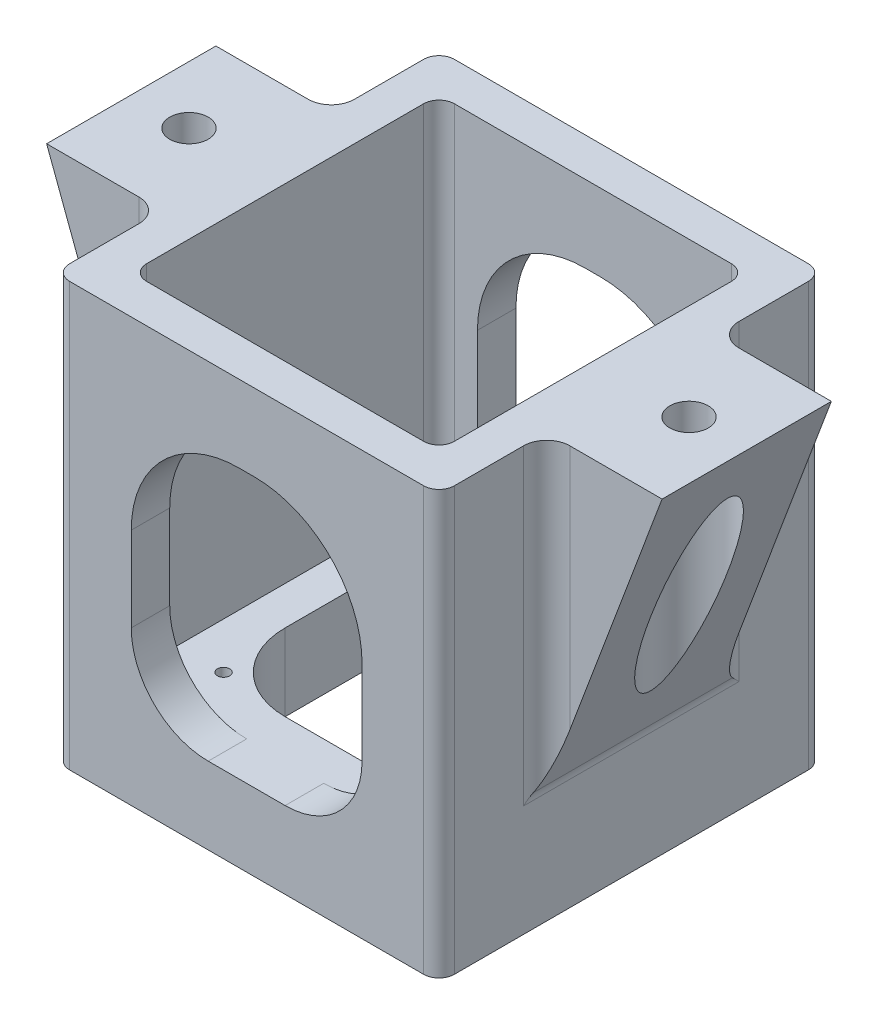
ISO-10303-21;
HEADER;
FILE_DESCRIPTION(('STEP AP214'),'2;1');
FILE_NAME('part.step','',(''),(''),'','','');
FILE_SCHEMA(('AUTOMOTIVE_DESIGN { 1 0 10303 214 1 1 1 1 }'));
ENDSEC;
DATA;
#1=APPLICATION_CONTEXT('core data for automotive mechanical design processes');
#2=APPLICATION_PROTOCOL_DEFINITION('international standard','automotive_design',2000,#1);
#3=PRODUCT_CONTEXT('',#1,'mechanical');
#4=PRODUCT('Part','Part','',(#3));
#5=PRODUCT_RELATED_PRODUCT_CATEGORY('part','',(#4));
#6=PRODUCT_DEFINITION_FORMATION('','',#4);
#7=PRODUCT_DEFINITION_CONTEXT('part definition',#1,'design');
#8=PRODUCT_DEFINITION('design','',#6,#7);
#9=PRODUCT_DEFINITION_SHAPE('','',#8);
#10=(LENGTH_UNIT() NAMED_UNIT(*) SI_UNIT(.MILLI.,.METRE.));
#11=(NAMED_UNIT(*) PLANE_ANGLE_UNIT() SI_UNIT($,.RADIAN.));
#12=(NAMED_UNIT(*) SI_UNIT($,.STERADIAN.) SOLID_ANGLE_UNIT());
#13=UNCERTAINTY_MEASURE_WITH_UNIT(LENGTH_MEASURE(1.E-05),#10,'distance_accuracy_value','');
#14=(GEOMETRIC_REPRESENTATION_CONTEXT(3) GLOBAL_UNCERTAINTY_ASSIGNED_CONTEXT((#13)) GLOBAL_UNIT_ASSIGNED_CONTEXT((#10,
#11,#12)) REPRESENTATION_CONTEXT('',''));
#15=CARTESIAN_POINT('',(0.,0.,0.));
#16=DIRECTION('',(0.,0.,1.));
#17=DIRECTION('',(1.,0.,0.));
#18=AXIS2_PLACEMENT_3D('',#15,#16,#17);
#19=CARTESIAN_POINT('',(-25.,55.,25.));
#20=DIRECTION('',(0.,0.,-1.));
#21=DIRECTION('',(-1.,0.,0.));
#22=AXIS2_PLACEMENT_3D('',#19,#20,#21);
#23=PLANE('',#22);
#24=DIRECTION('',(1.,0.,0.));
#25=VECTOR('',#24,1.);
#26=CARTESIAN_POINT('',(-25.,0.,25.));
#27=LINE('',#26,#25);
#28=CARTESIAN_POINT('',(-23.,0.,25.));
#29=VERTEX_POINT('',#28);
#30=CARTESIAN_POINT('',(23.,0.,25.));
#31=VERTEX_POINT('',#30);
#32=EDGE_CURVE('E647',#29,#31,#27,.T.);
#33=ORIENTED_EDGE('',*,*,#32,.T.);
#34=DIRECTION('',(0.,-1.,0.));
#35=VECTOR('',#34,1.);
#36=CARTESIAN_POINT('',(23.,55.,25.));
#37=LINE('',#36,#35);
#38=CARTESIAN_POINT('',(23.,55.,25.));
#39=VERTEX_POINT('',#38);
#40=EDGE_CURVE('E745',#31,#39,#37,.F.);
#41=ORIENTED_EDGE('',*,*,#40,.T.);
#42=DIRECTION('',(1.,0.,0.));
#43=VECTOR('',#42,1.);
#44=CARTESIAN_POINT('',(-25.,55.,25.));
#45=LINE('',#44,#43);
#46=CARTESIAN_POINT('',(-23.,55.,25.));
#47=VERTEX_POINT('',#46);
#48=EDGE_CURVE('E636',#47,#39,#45,.T.);
#49=ORIENTED_EDGE('',*,*,#48,.F.);
#50=DIRECTION('',(0.,-1.,0.));
#51=VECTOR('',#50,1.);
#52=CARTESIAN_POINT('',(-23.,55.,25.));
#53=LINE('',#52,#51);
#54=EDGE_CURVE('E742',#47,#29,#53,.T.);
#55=ORIENTED_EDGE('',*,*,#54,.T.);
#56=EDGE_LOOP('',(#33,#41,#49,#55));
#57=FACE_BOUND('',#56,.T.);
#58=CARTESIAN_POINT('',(4.99999999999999,20.,25.));
#59=DIRECTION('',(0.,0.,-1.));
#60=DIRECTION('',(1.,0.,0.));
#61=AXIS2_PLACEMENT_3D('',#58,#59,#60);
#62=CIRCLE('',#61,10.);
#63=CARTESIAN_POINT('',(15.,20.0000000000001,25.));
#64=VERTEX_POINT('',#63);
#65=CARTESIAN_POINT('',(4.99999999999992,10.,25.));
#66=VERTEX_POINT('',#65);
#67=EDGE_CURVE('E395',#64,#66,#62,.T.);
#68=ORIENTED_EDGE('',*,*,#67,.T.);
#69=DIRECTION('',(-1.,0.,0.));
#70=VECTOR('',#69,1.);
#71=CARTESIAN_POINT('',(4.99999999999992,10.,25.));
#72=LINE('',#71,#70);
#73=CARTESIAN_POINT('',(-4.99999999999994,10.,25.));
#74=VERTEX_POINT('',#73);
#75=EDGE_CURVE('E419',#66,#74,#72,.T.);
#76=ORIENTED_EDGE('',*,*,#75,.T.);
#77=CARTESIAN_POINT('',(-5.00000000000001,20.,25.));
#78=DIRECTION('',(0.,0.,-1.));
#79=DIRECTION('',(-1.,0.,0.));
#80=AXIS2_PLACEMENT_3D('',#77,#78,#79);
#81=CIRCLE('',#80,10.);
#82=CARTESIAN_POINT('',(-15.,20.,25.));
#83=VERTEX_POINT('',#82);
#84=EDGE_CURVE('E383',#74,#83,#81,.T.);
#85=ORIENTED_EDGE('',*,*,#84,.T.);
#86=DIRECTION('',(0.,1.,0.));
#87=VECTOR('',#86,1.);
#88=CARTESIAN_POINT('',(-15.,20.0000000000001,25.));
#89=LINE('',#88,#87);
#90=CARTESIAN_POINT('',(-15.,31.,25.));
#91=VERTEX_POINT('',#90);
#92=EDGE_CURVE('E415',#83,#91,#89,.T.);
#93=ORIENTED_EDGE('',*,*,#92,.T.);
#94=CARTESIAN_POINT('',(-1.00000000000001,31.,25.));
#95=DIRECTION('',(0.,0.,-1.));
#96=DIRECTION('',(-1.,0.,0.));
#97=AXIS2_PLACEMENT_3D('',#94,#95,#96);
#98=CIRCLE('',#97,14.);
#99=CARTESIAN_POINT('',(-1.00000000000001,45.,25.));
#100=VERTEX_POINT('',#99);
#101=EDGE_CURVE('E412',#91,#100,#98,.T.);
#102=ORIENTED_EDGE('',*,*,#101,.T.);
#103=DIRECTION('',(1.,0.,0.));
#104=VECTOR('',#103,1.);
#105=CARTESIAN_POINT('',(-1.00000000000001,45.,25.));
#106=LINE('',#105,#104);
#107=CARTESIAN_POINT('',(0.999999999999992,45.,25.));
#108=VERTEX_POINT('',#107);
#109=EDGE_CURVE('E409',#100,#108,#106,.T.);
#110=ORIENTED_EDGE('',*,*,#109,.T.);
#111=CARTESIAN_POINT('',(0.99999999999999,31.,25.));
#112=DIRECTION('',(0.,0.,-1.));
#113=DIRECTION('',(-1.,0.,0.));
#114=AXIS2_PLACEMENT_3D('',#111,#112,#113);
#115=CIRCLE('',#114,14.);
#116=CARTESIAN_POINT('',(15.,31.,25.));
#117=VERTEX_POINT('',#116);
#118=EDGE_CURVE('E406',#108,#117,#115,.T.);
#119=ORIENTED_EDGE('',*,*,#118,.T.);
#120=DIRECTION('',(0.,-1.,0.));
#121=VECTOR('',#120,1.);
#122=CARTESIAN_POINT('',(15.,31.,25.));
#123=LINE('',#122,#121);
#124=EDGE_CURVE('E403',#117,#64,#123,.T.);
#125=ORIENTED_EDGE('',*,*,#124,.T.);
#126=EDGE_LOOP('',(#68,#76,#85,#93,#102,#110,#119,#125));
#127=FACE_BOUND('',#126,.T.);
#128=ADVANCED_FACE('F36',(#57,#127),#23,.F.);
#129=CARTESIAN_POINT('',(-20.,-56.5685424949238,20.));
#130=DIRECTION('',(0.,0.,1.));
#131=DIRECTION('',(1.,0.,0.));
#132=AXIS2_PLACEMENT_3D('',#129,#130,#131);
#133=PLANE('',#132);
#134=DIRECTION('',(1.,0.,0.));
#135=VECTOR('',#134,1.);
#136=CARTESIAN_POINT('',(-20.,10.,20.));
#137=LINE('',#136,#135);
#138=CARTESIAN_POINT('',(-18.,10.,20.));
#139=VERTEX_POINT('',#138);
#140=CARTESIAN_POINT('',(-5.00000000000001,10.,20.));
#141=VERTEX_POINT('',#140);
#142=EDGE_CURVE('E360',#139,#141,#137,.T.);
#143=ORIENTED_EDGE('',*,*,#142,.F.);
#144=DIRECTION('',(0.,1.,0.));
#145=VECTOR('',#144,1.);
#146=CARTESIAN_POINT('',(-18.,55.,20.));
#147=LINE('',#146,#145);
#148=CARTESIAN_POINT('',(-18.,55.,20.));
#149=VERTEX_POINT('',#148);
#150=EDGE_CURVE('E722',#139,#149,#147,.T.);
#151=ORIENTED_EDGE('',*,*,#150,.T.);
#152=DIRECTION('',(1.,0.,0.));
#153=VECTOR('',#152,1.);
#154=CARTESIAN_POINT('',(-20.,55.,20.));
#155=LINE('',#154,#153);
#156=CARTESIAN_POINT('',(18.,55.,20.));
#157=VERTEX_POINT('',#156);
#158=EDGE_CURVE('E615',#149,#157,#155,.T.);
#159=ORIENTED_EDGE('',*,*,#158,.T.);
#160=DIRECTION('',(0.,1.,0.));
#161=VECTOR('',#160,1.);
#162=CARTESIAN_POINT('',(18.,10.,20.));
#163=LINE('',#162,#161);
#164=CARTESIAN_POINT('',(18.,10.,20.));
#165=VERTEX_POINT('',#164);
#166=EDGE_CURVE('E720',#157,#165,#163,.F.);
#167=ORIENTED_EDGE('',*,*,#166,.T.);
#168=CARTESIAN_POINT('',(4.99999999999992,10.,20.));
#169=VERTEX_POINT('',#168);
#170=EDGE_CURVE('E376',#169,#165,#137,.T.);
#171=ORIENTED_EDGE('',*,*,#170,.F.);
#172=CARTESIAN_POINT('',(4.99999999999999,20.,20.));
#173=DIRECTION('',(0.,0.,1.));
#174=DIRECTION('',(1.,0.,0.));
#175=AXIS2_PLACEMENT_3D('',#172,#173,#174);
#176=CIRCLE('',#175,10.);
#177=CARTESIAN_POINT('',(15.,20.0000000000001,20.));
#178=VERTEX_POINT('',#177);
#179=EDGE_CURVE('E392',#169,#178,#176,.T.);
#180=ORIENTED_EDGE('',*,*,#179,.T.);
#181=DIRECTION('',(0.,1.,0.));
#182=VECTOR('',#181,1.);
#183=CARTESIAN_POINT('',(15.,31.,20.));
#184=LINE('',#183,#182);
#185=CARTESIAN_POINT('',(15.,31.,20.));
#186=VERTEX_POINT('',#185);
#187=EDGE_CURVE('E422',#178,#186,#184,.T.);
#188=ORIENTED_EDGE('',*,*,#187,.T.);
#189=CARTESIAN_POINT('',(0.99999999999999,31.,20.));
#190=DIRECTION('',(0.,0.,1.));
#191=DIRECTION('',(1.,0.,0.));
#192=AXIS2_PLACEMENT_3D('',#189,#190,#191);
#193=CIRCLE('',#192,14.);
#194=CARTESIAN_POINT('',(0.999999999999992,45.,20.));
#195=VERTEX_POINT('',#194);
#196=EDGE_CURVE('E835',#186,#195,#193,.T.);
#197=ORIENTED_EDGE('',*,*,#196,.T.);
#198=DIRECTION('',(-1.,0.,0.));
#199=VECTOR('',#198,1.);
#200=CARTESIAN_POINT('',(-1.00000000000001,45.,20.));
#201=LINE('',#200,#199);
#202=CARTESIAN_POINT('',(-1.00000000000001,45.,20.));
#203=VERTEX_POINT('',#202);
#204=EDGE_CURVE('E837',#195,#203,#201,.T.);
#205=ORIENTED_EDGE('',*,*,#204,.T.);
#206=CARTESIAN_POINT('',(-1.00000000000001,31.,20.));
#207=DIRECTION('',(0.,0.,1.));
#208=DIRECTION('',(1.,0.,0.));
#209=AXIS2_PLACEMENT_3D('',#206,#207,#208);
#210=CIRCLE('',#209,14.);
#211=CARTESIAN_POINT('',(-15.,31.,20.));
#212=VERTEX_POINT('',#211);
#213=EDGE_CURVE('E397',#203,#212,#210,.T.);
#214=ORIENTED_EDGE('',*,*,#213,.T.);
#215=DIRECTION('',(0.,-1.,0.));
#216=VECTOR('',#215,1.);
#217=CARTESIAN_POINT('',(-15.,20.0000000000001,20.));
#218=LINE('',#217,#216);
#219=CARTESIAN_POINT('',(-15.,20.,20.));
#220=VERTEX_POINT('',#219);
#221=EDGE_CURVE('E391',#212,#220,#218,.T.);
#222=ORIENTED_EDGE('',*,*,#221,.T.);
#223=CARTESIAN_POINT('',(-5.00000000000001,20.,20.));
#224=DIRECTION('',(0.,0.,1.));
#225=DIRECTION('',(1.,0.,0.));
#226=AXIS2_PLACEMENT_3D('',#223,#224,#225);
#227=CIRCLE('',#226,10.);
#228=EDGE_CURVE('E380',#220,#141,#227,.T.);
#229=ORIENTED_EDGE('',*,*,#228,.T.);
#230=EDGE_LOOP('',(#143,#151,#159,#167,#171,#180,#188,#197,#205,#214,#222,#229));
#231=FACE_BOUND('',#230,.T.);
#232=ADVANCED_FACE('F389',(#231),#133,.F.);
#233=CARTESIAN_POINT('',(-25.,55.,25.));
#234=DIRECTION('',(1.,0.,0.));
#235=DIRECTION('',(0.,0.,-1.));
#236=AXIS2_PLACEMENT_3D('',#233,#234,#235);
#237=PLANE('',#236);
#238=DIRECTION('',(0.,0.,1.));
#239=VECTOR('',#238,1.);
#240=CARTESIAN_POINT('',(-25.,0.,25.));
#241=LINE('',#240,#239);
#242=CARTESIAN_POINT('',(-25.,0.,-23.));
#243=VERTEX_POINT('',#242);
#244=CARTESIAN_POINT('',(-25.,0.,23.));
#245=VERTEX_POINT('',#244);
#246=EDGE_CURVE('E645',#243,#245,#241,.T.);
#247=ORIENTED_EDGE('',*,*,#246,.T.);
#248=DIRECTION('',(0.,-1.,0.));
#249=VECTOR('',#248,1.);
#250=CARTESIAN_POINT('',(-25.,55.,23.));
#251=LINE('',#250,#249);
#252=CARTESIAN_POINT('',(-25.,55.,23.));
#253=VERTEX_POINT('',#252);
#254=EDGE_CURVE('E51',#245,#253,#251,.F.);
#255=ORIENTED_EDGE('',*,*,#254,.T.);
#256=DIRECTION('',(0.,0.,1.));
#257=VECTOR('',#256,1.);
#258=CARTESIAN_POINT('',(-25.,55.,25.));
#259=LINE('',#258,#257);
#260=CARTESIAN_POINT('',(-25.,55.,14.));
#261=VERTEX_POINT('',#260);
#262=EDGE_CURVE('E633',#261,#253,#259,.T.);
#263=ORIENTED_EDGE('',*,*,#262,.F.);
#264=DIRECTION('',(0.,-1.,0.));
#265=VECTOR('',#264,1.);
#266=CARTESIAN_POINT('',(-25.,15.,14.));
#267=LINE('',#266,#265);
#268=CARTESIAN_POINT('',(-25.,15.,14.));
#269=VERTEX_POINT('',#268);
#270=EDGE_CURVE('E660',#261,#269,#267,.T.);
#271=ORIENTED_EDGE('',*,*,#270,.T.);
#272=DIRECTION('',(0.,0.,-1.));
#273=VECTOR('',#272,1.);
#274=CARTESIAN_POINT('',(-25.,15.,11.));
#275=LINE('',#274,#273);
#276=CARTESIAN_POINT('',(-25.,15.,-14.));
#277=VERTEX_POINT('',#276);
#278=EDGE_CURVE('E515',#269,#277,#275,.T.);
#279=ORIENTED_EDGE('',*,*,#278,.T.);
#280=DIRECTION('',(0.,-1.,0.));
#281=VECTOR('',#280,1.);
#282=CARTESIAN_POINT('',(-25.,55.,-14.));
#283=LINE('',#282,#281);
#284=CARTESIAN_POINT('',(-25.,55.,-14.));
#285=VERTEX_POINT('',#284);
#286=EDGE_CURVE('E663',#277,#285,#283,.F.);
#287=ORIENTED_EDGE('',*,*,#286,.T.);
#288=CARTESIAN_POINT('',(-25.,55.,-23.));
#289=VERTEX_POINT('',#288);
#290=EDGE_CURVE('E634',#289,#285,#259,.T.);
#291=ORIENTED_EDGE('',*,*,#290,.F.);
#292=DIRECTION('',(0.,-1.,0.));
#293=VECTOR('',#292,1.);
#294=CARTESIAN_POINT('',(-25.,55.,-23.));
#295=LINE('',#294,#293);
#296=EDGE_CURVE('E754',#289,#243,#295,.T.);
#297=ORIENTED_EDGE('',*,*,#296,.T.);
#298=EDGE_LOOP('',(#247,#255,#263,#271,#279,#287,#291,#297));
#299=FACE_BOUND('',#298,.T.);
#300=ADVANCED_FACE('F869',(#299),#237,.F.);
#301=CARTESIAN_POINT('',(0.,10.,0.));
#302=DIRECTION('',(0.,-1.,0.));
#303=DIRECTION('',(0.,0.,-1.));
#304=AXIS2_PLACEMENT_3D('',#301,#302,#303);
#305=PLANE('',#304);
#306=CARTESIAN_POINT('',(14.,10.,-14.));
#307=DIRECTION('',(0.,1.,0.));
#308=DIRECTION('',(0.,0.,1.));
#309=AXIS2_PLACEMENT_3D('',#306,#307,#308);
#310=CIRCLE('',#309,0.800000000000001);
#311=CARTESIAN_POINT('',(14.,10.,-13.2));
#312=VERTEX_POINT('',#311);
#313=EDGE_CURVE('E1399',#312,#312,#310,.T.);
#314=ORIENTED_EDGE('',*,*,#313,.F.);
#315=EDGE_LOOP('',(#314));
#316=FACE_BOUND('',#315,.T.);
#317=CARTESIAN_POINT('',(-14.,10.,-14.));
#318=DIRECTION('',(0.,1.,0.));
#319=DIRECTION('',(0.,0.,1.));
#320=AXIS2_PLACEMENT_3D('',#317,#318,#319);
#321=CIRCLE('',#320,0.800000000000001);
#322=CARTESIAN_POINT('',(-14.,10.,-13.2));
#323=VERTEX_POINT('',#322);
#324=EDGE_CURVE('E1403',#323,#323,#321,.T.);
#325=ORIENTED_EDGE('',*,*,#324,.F.);
#326=EDGE_LOOP('',(#325));
#327=FACE_BOUND('',#326,.T.);
#328=CARTESIAN_POINT('',(-14.,10.,14.));
#329=DIRECTION('',(0.,1.,0.));
#330=DIRECTION('',(0.,0.,1.));
#331=AXIS2_PLACEMENT_3D('',#328,#329,#330);
#332=CIRCLE('',#331,0.800000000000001);
#333=CARTESIAN_POINT('',(-14.,10.,14.8));
#334=VERTEX_POINT('',#333);
#335=EDGE_CURVE('E1412',#334,#334,#332,.T.);
#336=ORIENTED_EDGE('',*,*,#335,.F.);
#337=EDGE_LOOP('',(#336));
#338=FACE_BOUND('',#337,.T.);
#339=CARTESIAN_POINT('',(14.,10.,14.));
#340=DIRECTION('',(0.,1.,0.));
#341=DIRECTION('',(0.,0.,1.));
#342=AXIS2_PLACEMENT_3D('',#339,#340,#341);
#343=CIRCLE('',#342,0.800000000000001);
#344=CARTESIAN_POINT('',(14.,10.,14.8));
#345=VERTEX_POINT('',#344);
#346=EDGE_CURVE('E838',#345,#345,#343,.T.);
#347=ORIENTED_EDGE('',*,*,#346,.F.);
#348=EDGE_LOOP('',(#347));
#349=FACE_BOUND('',#348,.T.);
#350=DIRECTION('',(-1.,0.,0.));
#351=VECTOR('',#350,1.);
#352=CARTESIAN_POINT('',(20.,10.,-20.));
#353=LINE('',#352,#351);
#354=CARTESIAN_POINT('',(-4.99999999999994,10.,-20.));
#355=VERTEX_POINT('',#354);
#356=CARTESIAN_POINT('',(-18.,10.,-20.));
#357=VERTEX_POINT('',#356);
#358=EDGE_CURVE('E625',#355,#357,#353,.T.);
#359=ORIENTED_EDGE('',*,*,#358,.T.);
#360=CARTESIAN_POINT('',(-18.,10.,-18.));
#361=DIRECTION('',(0.,-1.,0.));
#362=DIRECTION('',(0.,0.,-1.));
#363=AXIS2_PLACEMENT_3D('',#360,#361,#362);
#364=CIRCLE('',#363,2.);
#365=CARTESIAN_POINT('',(-20.,10.,-18.));
#366=VERTEX_POINT('',#365);
#367=EDGE_CURVE('E718',#357,#366,#364,.F.);
#368=ORIENTED_EDGE('',*,*,#367,.T.);
#369=DIRECTION('',(0.,0.,1.));
#370=VECTOR('',#369,1.);
#371=CARTESIAN_POINT('',(-20.,10.,-20.));
#372=LINE('',#371,#370);
#373=CARTESIAN_POINT('',(-20.,10.,18.));
#374=VERTEX_POINT('',#373);
#375=EDGE_CURVE('E620',#366,#374,#372,.T.);
#376=ORIENTED_EDGE('',*,*,#375,.T.);
#377=CARTESIAN_POINT('',(-18.,10.,18.));
#378=DIRECTION('',(0.,-1.,0.));
#379=DIRECTION('',(0.,0.,-1.));
#380=AXIS2_PLACEMENT_3D('',#377,#378,#379);
#381=CIRCLE('',#380,2.);
#382=EDGE_CURVE('E370',#374,#139,#381,.F.);
#383=ORIENTED_EDGE('',*,*,#382,.T.);
#384=ORIENTED_EDGE('',*,*,#142,.T.);
#385=DIRECTION('',(0.,0.,1.));
#386=VECTOR('',#385,1.);
#387=CARTESIAN_POINT('',(-4.99999999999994,10.,-25.001));
#388=LINE('',#387,#386);
#389=EDGE_CURVE('E366',#141,#74,#388,.T.);
#390=ORIENTED_EDGE('',*,*,#389,.T.);
#391=ORIENTED_EDGE('',*,*,#75,.F.);
#392=DIRECTION('',(0.,0.,1.));
#393=VECTOR('',#392,1.);
#394=CARTESIAN_POINT('',(4.99999999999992,10.,-25.001));
#395=LINE('',#394,#393);
#396=EDGE_CURVE('E385',#169,#66,#395,.T.);
#397=ORIENTED_EDGE('',*,*,#396,.F.);
#398=ORIENTED_EDGE('',*,*,#170,.T.);
#399=CARTESIAN_POINT('',(18.,10.,18.));
#400=DIRECTION('',(0.,-1.,0.));
#401=DIRECTION('',(0.,0.,-1.));
#402=AXIS2_PLACEMENT_3D('',#399,#400,#401);
#403=CIRCLE('',#402,2.);
#404=CARTESIAN_POINT('',(20.,10.,18.));
#405=VERTEX_POINT('',#404);
#406=EDGE_CURVE('E713',#165,#405,#403,.F.);
#407=ORIENTED_EDGE('',*,*,#406,.T.);
#408=DIRECTION('',(0.,0.,-1.));
#409=VECTOR('',#408,1.);
#410=CARTESIAN_POINT('',(20.,10.,20.));
#411=LINE('',#410,#409);
#412=CARTESIAN_POINT('',(20.,10.,-18.));
#413=VERTEX_POINT('',#412);
#414=EDGE_CURVE('E375',#405,#413,#411,.T.);
#415=ORIENTED_EDGE('',*,*,#414,.T.);
#416=CARTESIAN_POINT('',(18.,10.,-18.));
#417=DIRECTION('',(0.,-1.,0.));
#418=DIRECTION('',(0.,0.,-1.));
#419=AXIS2_PLACEMENT_3D('',#416,#417,#418);
#420=CIRCLE('',#419,2.);
#421=CARTESIAN_POINT('',(18.,10.,-20.));
#422=VERTEX_POINT('',#421);
#423=EDGE_CURVE('E715',#413,#422,#420,.F.);
#424=ORIENTED_EDGE('',*,*,#423,.T.);
#425=CARTESIAN_POINT('',(4.99999999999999,10.,-20.));
#426=VERTEX_POINT('',#425);
#427=EDGE_CURVE('E623',#422,#426,#353,.T.);
#428=ORIENTED_EDGE('',*,*,#427,.T.);
#429=DIRECTION('',(0.,0.,-1.));
#430=VECTOR('',#429,1.);
#431=CARTESIAN_POINT('',(4.99999999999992,10.,25.001));
#432=LINE('',#431,#430);
#433=CARTESIAN_POINT('',(4.99999999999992,10.,-25.));
#434=VERTEX_POINT('',#433);
#435=EDGE_CURVE('E485',#426,#434,#432,.T.);
#436=ORIENTED_EDGE('',*,*,#435,.T.);
#437=DIRECTION('',(-1.,0.,0.));
#438=VECTOR('',#437,1.);
#439=CARTESIAN_POINT('',(4.99999999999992,10.,-25.));
#440=LINE('',#439,#438);
#441=CARTESIAN_POINT('',(-4.99999999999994,10.,-25.));
#442=VERTEX_POINT('',#441);
#443=EDGE_CURVE('E456',#434,#442,#440,.T.);
#444=ORIENTED_EDGE('',*,*,#443,.T.);
#445=DIRECTION('',(0.,0.,-1.));
#446=VECTOR('',#445,1.);
#447=CARTESIAN_POINT('',(-4.99999999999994,10.,25.001));
#448=LINE('',#447,#446);
#449=EDGE_CURVE('E440',#355,#442,#448,.T.);
#450=ORIENTED_EDGE('',*,*,#449,.F.);
#451=EDGE_LOOP('',(#359,#368,#376,#383,#384,#390,#391,#397,#398,#407,#415,#424,#428,#436,#444,#450));
#452=FACE_BOUND('',#451,.T.);
#453=CARTESIAN_POINT('',(-5.,10.,5.));
#454=DIRECTION('',(0.,1.,0.));
#455=DIRECTION('',(0.,0.,1.));
#456=AXIS2_PLACEMENT_3D('',#453,#454,#455);
#457=CIRCLE('',#456,10.);
#458=CARTESIAN_POINT('',(-15.,10.,5.));
#459=VERTEX_POINT('',#458);
#460=CARTESIAN_POINT('',(-5.,10.,15.));
#461=VERTEX_POINT('',#460);
#462=EDGE_CURVE('E544',#459,#461,#457,.T.);
#463=ORIENTED_EDGE('',*,*,#462,.F.);
#464=DIRECTION('',(0.,0.,1.));
#465=VECTOR('',#464,1.);
#466=CARTESIAN_POINT('',(-15.,10.,-5.));
#467=LINE('',#466,#465);
#468=CARTESIAN_POINT('',(-15.,10.,-5.));
#469=VERTEX_POINT('',#468);
#470=EDGE_CURVE('E545',#469,#459,#467,.T.);
#471=ORIENTED_EDGE('',*,*,#470,.F.);
#472=CARTESIAN_POINT('',(-5.,10.,-5.));
#473=DIRECTION('',(0.,1.,0.));
#474=DIRECTION('',(0.,0.,1.));
#475=AXIS2_PLACEMENT_3D('',#472,#473,#474);
#476=CIRCLE('',#475,10.);
#477=CARTESIAN_POINT('',(-5.,10.,-15.));
#478=VERTEX_POINT('',#477);
#479=EDGE_CURVE('E549',#478,#469,#476,.T.);
#480=ORIENTED_EDGE('',*,*,#479,.F.);
#481=DIRECTION('',(-1.,0.,0.));
#482=VECTOR('',#481,1.);
#483=CARTESIAN_POINT('',(4.99999999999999,10.,-15.));
#484=LINE('',#483,#482);
#485=CARTESIAN_POINT('',(4.99999999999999,10.,-15.));
#486=VERTEX_POINT('',#485);
#487=EDGE_CURVE('E551',#486,#478,#484,.T.);
#488=ORIENTED_EDGE('',*,*,#487,.F.);
#489=CARTESIAN_POINT('',(4.99999999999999,10.,-5.));
#490=DIRECTION('',(0.,1.,0.));
#491=DIRECTION('',(0.,0.,-1.));
#492=AXIS2_PLACEMENT_3D('',#489,#490,#491);
#493=CIRCLE('',#492,10.);
#494=CARTESIAN_POINT('',(15.,10.,-5.));
#495=VERTEX_POINT('',#494);
#496=EDGE_CURVE('E554',#495,#486,#493,.T.);
#497=ORIENTED_EDGE('',*,*,#496,.F.);
#498=DIRECTION('',(0.,0.,-1.));
#499=VECTOR('',#498,1.);
#500=CARTESIAN_POINT('',(15.,10.,5.));
#501=LINE('',#500,#499);
#502=CARTESIAN_POINT('',(15.,10.,5.));
#503=VERTEX_POINT('',#502);
#504=EDGE_CURVE('E557',#503,#495,#501,.T.);
#505=ORIENTED_EDGE('',*,*,#504,.F.);
#506=CARTESIAN_POINT('',(4.99999999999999,10.,5.));
#507=DIRECTION('',(0.,1.,0.));
#508=DIRECTION('',(0.,0.,1.));
#509=AXIS2_PLACEMENT_3D('',#506,#507,#508);
#510=CIRCLE('',#509,10.);
#511=CARTESIAN_POINT('',(4.99999999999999,10.,15.));
#512=VERTEX_POINT('',#511);
#513=EDGE_CURVE('E560',#512,#503,#510,.T.);
#514=ORIENTED_EDGE('',*,*,#513,.F.);
#515=DIRECTION('',(1.,0.,0.));
#516=VECTOR('',#515,1.);
#517=CARTESIAN_POINT('',(-5.,10.,15.));
#518=LINE('',#517,#516);
#519=EDGE_CURVE('E563',#461,#512,#518,.T.);
#520=ORIENTED_EDGE('',*,*,#519,.F.);
#521=EDGE_LOOP('',(#463,#471,#480,#488,#497,#505,#514,#520));
#522=FACE_BOUND('',#521,.T.);
#523=ADVANCED_FACE('F363',(#316,#327,#338,#349,#452,#522),#305,.F.);
#524=CARTESIAN_POINT('',(25.,55.,25.));
#525=DIRECTION('',(-1.,0.,0.));
#526=DIRECTION('',(0.,0.,1.));
#527=AXIS2_PLACEMENT_3D('',#524,#525,#526);
#528=PLANE('',#527);
#529=DIRECTION('',(0.,0.,-1.));
#530=VECTOR('',#529,1.);
#531=CARTESIAN_POINT('',(25.,55.,25.));
#532=LINE('',#531,#530);
#533=CARTESIAN_POINT('',(25.,55.,23.));
#534=VERTEX_POINT('',#533);
#535=CARTESIAN_POINT('',(25.,55.,14.));
#536=VERTEX_POINT('',#535);
#537=EDGE_CURVE('E628',#534,#536,#532,.T.);
#538=ORIENTED_EDGE('',*,*,#537,.F.);
#539=DIRECTION('',(0.,-1.,0.));
#540=VECTOR('',#539,1.);
#541=CARTESIAN_POINT('',(25.,55.,23.));
#542=LINE('',#541,#540);
#543=CARTESIAN_POINT('',(25.,0.,23.));
#544=VERTEX_POINT('',#543);
#545=EDGE_CURVE('E731',#534,#544,#542,.T.);
#546=ORIENTED_EDGE('',*,*,#545,.T.);
#547=DIRECTION('',(0.,0.,-1.));
#548=VECTOR('',#547,1.);
#549=CARTESIAN_POINT('',(25.,0.,25.));
#550=LINE('',#549,#548);
#551=CARTESIAN_POINT('',(25.,0.,-23.));
#552=VERTEX_POINT('',#551);
#553=EDGE_CURVE('E622',#544,#552,#550,.T.);
#554=ORIENTED_EDGE('',*,*,#553,.T.);
#555=DIRECTION('',(0.,-1.,0.));
#556=VECTOR('',#555,1.);
#557=CARTESIAN_POINT('',(25.,55.,-23.));
#558=LINE('',#557,#556);
#559=CARTESIAN_POINT('',(25.,55.,-23.));
#560=VERTEX_POINT('',#559);
#561=EDGE_CURVE('E729',#552,#560,#558,.F.);
#562=ORIENTED_EDGE('',*,*,#561,.T.);
#563=CARTESIAN_POINT('',(25.,55.,-14.));
#564=VERTEX_POINT('',#563);
#565=EDGE_CURVE('E631',#564,#560,#532,.T.);
#566=ORIENTED_EDGE('',*,*,#565,.F.);
#567=DIRECTION('',(0.,-1.,0.));
#568=VECTOR('',#567,1.);
#569=CARTESIAN_POINT('',(25.,55.,-14.));
#570=LINE('',#569,#568);
#571=CARTESIAN_POINT('',(25.,14.4559962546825,-14.));
#572=VERTEX_POINT('',#571);
#573=EDGE_CURVE('E673',#564,#572,#570,.T.);
#574=ORIENTED_EDGE('',*,*,#573,.T.);
#575=DIRECTION('',(0.,0.,-1.));
#576=VECTOR('',#575,1.);
#577=CARTESIAN_POINT('',(25.,14.4559962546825,11.));
#578=LINE('',#577,#576);
#579=CARTESIAN_POINT('',(25.,14.4559962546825,14.));
#580=VERTEX_POINT('',#579);
#581=EDGE_CURVE('E671',#572,#580,#578,.F.);
#582=ORIENTED_EDGE('',*,*,#581,.T.);
#583=DIRECTION('',(0.,-1.,0.));
#584=VECTOR('',#583,1.);
#585=CARTESIAN_POINT('',(25.,55.,14.));
#586=LINE('',#585,#584);
#587=EDGE_CURVE('E668',#580,#536,#586,.F.);
#588=ORIENTED_EDGE('',*,*,#587,.T.);
#589=EDGE_LOOP('',(#538,#546,#554,#562,#566,#574,#582,#588));
#590=FACE_BOUND('',#589,.T.);
#591=ADVANCED_FACE('F879',(#590),#528,.F.);
#592=CARTESIAN_POINT('',(-25.,55.,-25.));
#593=DIRECTION('',(0.,0.,1.));
#594=DIRECTION('',(1.,0.,0.));
#595=AXIS2_PLACEMENT_3D('',#592,#593,#594);
#596=PLANE('',#595);
#597=CARTESIAN_POINT('',(-5.00000000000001,20.,-25.));
#598=DIRECTION('',(0.,0.,-1.));
#599=DIRECTION('',(-1.,0.,0.));
#600=AXIS2_PLACEMENT_3D('',#597,#598,#599);
#601=CIRCLE('',#600,10.);
#602=CARTESIAN_POINT('',(-15.,20.,-25.));
#603=VERTEX_POINT('',#602);
#604=EDGE_CURVE('E453',#442,#603,#601,.T.);
#605=ORIENTED_EDGE('',*,*,#604,.F.);
#606=ORIENTED_EDGE('',*,*,#443,.F.);
#607=CARTESIAN_POINT('',(4.99999999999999,20.,-25.));
#608=DIRECTION('',(0.,0.,-1.));
#609=DIRECTION('',(1.,0.,0.));
#610=AXIS2_PLACEMENT_3D('',#607,#608,#609);
#611=CIRCLE('',#610,10.);
#612=CARTESIAN_POINT('',(15.,20.,-25.));
#613=VERTEX_POINT('',#612);
#614=EDGE_CURVE('E459',#613,#434,#611,.T.);
#615=ORIENTED_EDGE('',*,*,#614,.F.);
#616=DIRECTION('',(0.,-1.,0.));
#617=VECTOR('',#616,1.);
#618=CARTESIAN_POINT('',(15.,31.,-25.));
#619=LINE('',#618,#617);
#620=CARTESIAN_POINT('',(15.,31.,-25.));
#621=VERTEX_POINT('',#620);
#622=EDGE_CURVE('E438',#621,#613,#619,.T.);
#623=ORIENTED_EDGE('',*,*,#622,.F.);
#624=CARTESIAN_POINT('',(0.99999999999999,31.,-25.));
#625=DIRECTION('',(0.,0.,-1.));
#626=DIRECTION('',(-1.,0.,0.));
#627=AXIS2_PLACEMENT_3D('',#624,#625,#626);
#628=CIRCLE('',#627,14.);
#629=CARTESIAN_POINT('',(0.999999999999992,45.,-25.));
#630=VERTEX_POINT('',#629);
#631=EDGE_CURVE('E441',#630,#621,#628,.T.);
#632=ORIENTED_EDGE('',*,*,#631,.F.);
#633=DIRECTION('',(1.,0.,0.));
#634=VECTOR('',#633,1.);
#635=CARTESIAN_POINT('',(-1.00000000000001,45.,-25.));
#636=LINE('',#635,#634);
#637=CARTESIAN_POINT('',(-1.00000000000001,45.,-25.));
#638=VERTEX_POINT('',#637);
#639=EDGE_CURVE('E444',#638,#630,#636,.T.);
#640=ORIENTED_EDGE('',*,*,#639,.F.);
#641=CARTESIAN_POINT('',(-1.00000000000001,31.,-25.));
#642=DIRECTION('',(0.,0.,-1.));
#643=DIRECTION('',(-1.,0.,0.));
#644=AXIS2_PLACEMENT_3D('',#641,#642,#643);
#645=CIRCLE('',#644,14.);
#646=CARTESIAN_POINT('',(-15.,31.,-25.));
#647=VERTEX_POINT('',#646);
#648=EDGE_CURVE('E447',#647,#638,#645,.T.);
#649=ORIENTED_EDGE('',*,*,#648,.F.);
#650=DIRECTION('',(0.,1.,0.));
#651=VECTOR('',#650,1.);
#652=CARTESIAN_POINT('',(-15.,20.0000000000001,-25.));
#653=LINE('',#652,#651);
#654=EDGE_CURVE('E450',#603,#647,#653,.T.);
#655=ORIENTED_EDGE('',*,*,#654,.F.);
#656=EDGE_LOOP('',(#605,#606,#615,#623,#632,#640,#649,#655));
#657=FACE_BOUND('',#656,.T.);
#658=DIRECTION('',(-1.,0.,0.));
#659=VECTOR('',#658,1.);
#660=CARTESIAN_POINT('',(-25.,0.,-25.));
#661=LINE('',#660,#659);
#662=CARTESIAN_POINT('',(23.,0.,-25.));
#663=VERTEX_POINT('',#662);
#664=CARTESIAN_POINT('',(-23.,0.,-25.));
#665=VERTEX_POINT('',#664);
#666=EDGE_CURVE('E642',#663,#665,#661,.T.);
#667=ORIENTED_EDGE('',*,*,#666,.T.);
#668=DIRECTION('',(0.,-1.,0.));
#669=VECTOR('',#668,1.);
#670=CARTESIAN_POINT('',(-23.,55.,-25.));
#671=LINE('',#670,#669);
#672=CARTESIAN_POINT('',(-23.,55.,-25.));
#673=VERTEX_POINT('',#672);
#674=EDGE_CURVE('E761',#665,#673,#671,.F.);
#675=ORIENTED_EDGE('',*,*,#674,.T.);
#676=DIRECTION('',(-1.,0.,0.));
#677=VECTOR('',#676,1.);
#678=CARTESIAN_POINT('',(-25.,55.,-25.));
#679=LINE('',#678,#677);
#680=CARTESIAN_POINT('',(23.,55.,-25.));
#681=VERTEX_POINT('',#680);
#682=EDGE_CURVE('E630',#681,#673,#679,.T.);
#683=ORIENTED_EDGE('',*,*,#682,.F.);
#684=DIRECTION('',(0.,-1.,0.));
#685=VECTOR('',#684,1.);
#686=CARTESIAN_POINT('',(23.,55.,-25.));
#687=LINE('',#686,#685);
#688=EDGE_CURVE('E758',#681,#663,#687,.T.);
#689=ORIENTED_EDGE('',*,*,#688,.T.);
#690=EDGE_LOOP('',(#667,#675,#683,#689));
#691=FACE_BOUND('',#690,.T.);
#692=ADVANCED_FACE('F793',(#657,#691),#596,.F.);
#693=CARTESIAN_POINT('',(0.,55.,0.));
#694=DIRECTION('',(0.,-1.,0.));
#695=DIRECTION('',(0.,0.,-1.));
#696=AXIS2_PLACEMENT_3D('',#693,#694,#695);
#697=PLANE('',#696);
#698=CARTESIAN_POINT('',(-32.5,55.,0.));
#699=DIRECTION('',(0.,-1.,0.));
#700=DIRECTION('',(0.,0.,1.));
#701=AXIS2_PLACEMENT_3D('',#698,#699,#700);
#702=CIRCLE('',#701,2.5);
#703=CARTESIAN_POINT('',(-32.5,55.,2.5));
#704=VERTEX_POINT('',#703);
#705=EDGE_CURVE('E504',#704,#704,#702,.T.);
#706=ORIENTED_EDGE('',*,*,#705,.T.);
#707=EDGE_LOOP('',(#706));
#708=FACE_BOUND('',#707,.T.);
#709=CARTESIAN_POINT('',(32.5,55.,0.));
#710=DIRECTION('',(0.,1.,0.));
#711=DIRECTION('',(0.,0.,1.));
#712=AXIS2_PLACEMENT_3D('',#709,#710,#711);
#713=CIRCLE('',#712,2.5);
#714=CARTESIAN_POINT('',(32.5,55.,2.5));
#715=VERTEX_POINT('',#714);
#716=EDGE_CURVE('E527',#715,#715,#713,.T.);
#717=ORIENTED_EDGE('',*,*,#716,.F.);
#718=EDGE_LOOP('',(#717));
#719=FACE_BOUND('',#718,.T.);
#720=DIRECTION('',(0.,0.,-1.));
#721=VECTOR('',#720,1.);
#722=CARTESIAN_POINT('',(20.,55.,20.));
#723=LINE('',#722,#721);
#724=CARTESIAN_POINT('',(20.,55.,18.));
#725=VERTEX_POINT('',#724);
#726=CARTESIAN_POINT('',(20.,55.,-18.));
#727=VERTEX_POINT('',#726);
#728=EDGE_CURVE('E612',#725,#727,#723,.T.);
#729=ORIENTED_EDGE('',*,*,#728,.F.);
#730=CARTESIAN_POINT('',(18.,55.,18.));
#731=DIRECTION('',(0.,-1.,0.));
#732=DIRECTION('',(0.,0.,-1.));
#733=AXIS2_PLACEMENT_3D('',#730,#731,#732);
#734=CIRCLE('',#733,2.);
#735=EDGE_CURVE('E12',#725,#157,#734,.T.);
#736=ORIENTED_EDGE('',*,*,#735,.T.);
#737=ORIENTED_EDGE('',*,*,#158,.F.);
#738=CARTESIAN_POINT('',(-18.,55.,18.));
#739=DIRECTION('',(0.,-1.,0.));
#740=DIRECTION('',(0.,0.,-1.));
#741=AXIS2_PLACEMENT_3D('',#738,#739,#740);
#742=CIRCLE('',#741,2.);
#743=CARTESIAN_POINT('',(-20.,55.,18.));
#744=VERTEX_POINT('',#743);
#745=EDGE_CURVE('E765',#149,#744,#742,.T.);
#746=ORIENTED_EDGE('',*,*,#745,.T.);
#747=DIRECTION('',(0.,0.,1.));
#748=VECTOR('',#747,1.);
#749=CARTESIAN_POINT('',(-20.,55.,-20.));
#750=LINE('',#749,#748);
#751=CARTESIAN_POINT('',(-20.,55.,-18.));
#752=VERTEX_POINT('',#751);
#753=EDGE_CURVE('E608',#752,#744,#750,.T.);
#754=ORIENTED_EDGE('',*,*,#753,.F.);
#755=CARTESIAN_POINT('',(-18.,55.,-18.));
#756=DIRECTION('',(0.,-1.,0.));
#757=DIRECTION('',(0.,0.,-1.));
#758=AXIS2_PLACEMENT_3D('',#755,#756,#757);
#759=CIRCLE('',#758,2.);
#760=CARTESIAN_POINT('',(-18.,55.,-20.));
#761=VERTEX_POINT('',#760);
#762=EDGE_CURVE('E763',#752,#761,#759,.T.);
#763=ORIENTED_EDGE('',*,*,#762,.T.);
#764=DIRECTION('',(-1.,0.,0.));
#765=VECTOR('',#764,1.);
#766=CARTESIAN_POINT('',(20.,55.,-20.));
#767=LINE('',#766,#765);
#768=CARTESIAN_POINT('',(18.,55.,-20.));
#769=VERTEX_POINT('',#768);
#770=EDGE_CURVE('E609',#769,#761,#767,.T.);
#771=ORIENTED_EDGE('',*,*,#770,.F.);
#772=CARTESIAN_POINT('',(18.,55.,-18.));
#773=DIRECTION('',(0.,-1.,0.));
#774=DIRECTION('',(0.,0.,-1.));
#775=AXIS2_PLACEMENT_3D('',#772,#773,#774);
#776=CIRCLE('',#775,2.);
#777=EDGE_CURVE('E44',#769,#727,#776,.T.);
#778=ORIENTED_EDGE('',*,*,#777,.T.);
#779=EDGE_LOOP('',(#729,#736,#737,#746,#754,#763,#771,#778));
#780=FACE_BOUND('',#779,.T.);
#781=ORIENTED_EDGE('',*,*,#48,.T.);
#782=CARTESIAN_POINT('',(23.,55.,23.));
#783=DIRECTION('',(0.,-1.,0.));
#784=DIRECTION('',(0.,0.,-1.));
#785=AXIS2_PLACEMENT_3D('',#782,#783,#784);
#786=CIRCLE('',#785,2.);
#787=EDGE_CURVE('E752',#39,#534,#786,.F.);
#788=ORIENTED_EDGE('',*,*,#787,.T.);
#789=ORIENTED_EDGE('',*,*,#537,.T.);
#790=CARTESIAN_POINT('',(28.,55.,14.));
#791=DIRECTION('',(0.,-1.,0.));
#792=DIRECTION('',(0.,0.,-1.));
#793=AXIS2_PLACEMENT_3D('',#790,#791,#792);
#794=CIRCLE('',#793,3.);
#795=CARTESIAN_POINT('',(28.,55.,11.));
#796=VERTEX_POINT('',#795);
#797=EDGE_CURVE('E698',#536,#796,#794,.T.);
#798=ORIENTED_EDGE('',*,*,#797,.T.);
#799=DIRECTION('',(-1.,0.,0.));
#800=VECTOR('',#799,1.);
#801=CARTESIAN_POINT('',(25.,55.,11.));
#802=LINE('',#801,#800);
#803=CARTESIAN_POINT('',(40.,55.,11.));
#804=VERTEX_POINT('',#803);
#805=EDGE_CURVE('E532',#804,#796,#802,.T.);
#806=ORIENTED_EDGE('',*,*,#805,.F.);
#807=DIRECTION('',(0.,0.,-1.));
#808=VECTOR('',#807,1.);
#809=CARTESIAN_POINT('',(40.,55.,11.));
#810=LINE('',#809,#808);
#811=CARTESIAN_POINT('',(40.,55.,-11.));
#812=VERTEX_POINT('',#811);
#813=EDGE_CURVE('E538',#804,#812,#810,.T.);
#814=ORIENTED_EDGE('',*,*,#813,.T.);
#815=DIRECTION('',(-1.,0.,0.));
#816=VECTOR('',#815,1.);
#817=CARTESIAN_POINT('',(25.,55.,-11.));
#818=LINE('',#817,#816);
#819=CARTESIAN_POINT('',(28.,55.,-11.));
#820=VERTEX_POINT('',#819);
#821=EDGE_CURVE('E530',#812,#820,#818,.T.);
#822=ORIENTED_EDGE('',*,*,#821,.T.);
#823=CARTESIAN_POINT('',(28.,55.,-14.));
#824=DIRECTION('',(0.,-1.,0.));
#825=DIRECTION('',(0.,0.,-1.));
#826=AXIS2_PLACEMENT_3D('',#823,#824,#825);
#827=CIRCLE('',#826,3.);
#828=EDGE_CURVE('E693',#820,#564,#827,.T.);
#829=ORIENTED_EDGE('',*,*,#828,.T.);
#830=ORIENTED_EDGE('',*,*,#565,.T.);
#831=CARTESIAN_POINT('',(23.,55.,-23.));
#832=DIRECTION('',(0.,-1.,0.));
#833=DIRECTION('',(0.,0.,-1.));
#834=AXIS2_PLACEMENT_3D('',#831,#832,#833);
#835=CIRCLE('',#834,2.);
#836=EDGE_CURVE('E747',#560,#681,#835,.F.);
#837=ORIENTED_EDGE('',*,*,#836,.T.);
#838=ORIENTED_EDGE('',*,*,#682,.T.);
#839=CARTESIAN_POINT('',(-23.,55.,-23.));
#840=DIRECTION('',(0.,-1.,0.));
#841=DIRECTION('',(0.,0.,-1.));
#842=AXIS2_PLACEMENT_3D('',#839,#840,#841);
#843=CIRCLE('',#842,2.);
#844=EDGE_CURVE('E59',#673,#289,#843,.F.);
#845=ORIENTED_EDGE('',*,*,#844,.T.);
#846=ORIENTED_EDGE('',*,*,#290,.T.);
#847=CARTESIAN_POINT('',(-28.,55.,-14.));
#848=DIRECTION('',(0.,-1.,0.));
#849=DIRECTION('',(0.,0.,-1.));
#850=AXIS2_PLACEMENT_3D('',#847,#848,#849);
#851=CIRCLE('',#850,3.);
#852=CARTESIAN_POINT('',(-28.,55.,-11.));
#853=VERTEX_POINT('',#852);
#854=EDGE_CURVE('E685',#285,#853,#851,.T.);
#855=ORIENTED_EDGE('',*,*,#854,.T.);
#856=DIRECTION('',(1.,0.,0.));
#857=VECTOR('',#856,1.);
#858=CARTESIAN_POINT('',(-25.,55.,-11.));
#859=LINE('',#858,#857);
#860=CARTESIAN_POINT('',(-40.,55.,-11.));
#861=VERTEX_POINT('',#860);
#862=EDGE_CURVE('E507',#861,#853,#859,.T.);
#863=ORIENTED_EDGE('',*,*,#862,.F.);
#864=DIRECTION('',(0.,0.,-1.));
#865=VECTOR('',#864,1.);
#866=CARTESIAN_POINT('',(-40.,55.,11.));
#867=LINE('',#866,#865);
#868=CARTESIAN_POINT('',(-40.,55.,11.));
#869=VERTEX_POINT('',#868);
#870=EDGE_CURVE('E520',#869,#861,#867,.T.);
#871=ORIENTED_EDGE('',*,*,#870,.F.);
#872=DIRECTION('',(1.,0.,0.));
#873=VECTOR('',#872,1.);
#874=CARTESIAN_POINT('',(-25.,55.,11.));
#875=LINE('',#874,#873);
#876=CARTESIAN_POINT('',(-28.,55.,11.));
#877=VERTEX_POINT('',#876);
#878=EDGE_CURVE('E509',#869,#877,#875,.T.);
#879=ORIENTED_EDGE('',*,*,#878,.T.);
#880=CARTESIAN_POINT('',(-28.,55.,14.));
#881=DIRECTION('',(0.,-1.,0.));
#882=DIRECTION('',(0.,0.,-1.));
#883=AXIS2_PLACEMENT_3D('',#880,#881,#882);
#884=CIRCLE('',#883,3.);
#885=EDGE_CURVE('E689',#877,#261,#884,.T.);
#886=ORIENTED_EDGE('',*,*,#885,.T.);
#887=ORIENTED_EDGE('',*,*,#262,.T.);
#888=CARTESIAN_POINT('',(-23.,55.,23.));
#889=DIRECTION('',(0.,-1.,0.));
#890=DIRECTION('',(0.,0.,-1.));
#891=AXIS2_PLACEMENT_3D('',#888,#889,#890);
#892=CIRCLE('',#891,2.);
#893=EDGE_CURVE('E750',#253,#47,#892,.F.);
#894=ORIENTED_EDGE('',*,*,#893,.T.);
#895=EDGE_LOOP('',(#781,#788,#789,#798,#806,#814,#822,#829,#830,#837,#838,#845,#846,#855,#863,
#871,#879,#886,#887,#894));
#896=FACE_BOUND('',#895,.T.);
#897=ADVANCED_FACE('F769',(#708,#719,#780,#896),#697,.F.);
#898=CARTESIAN_POINT('',(0.,0.,0.));
#899=DIRECTION('',(0.,-1.,0.));
#900=DIRECTION('',(0.,0.,-1.));
#901=AXIS2_PLACEMENT_3D('',#898,#899,#900);
#902=PLANE('',#901);
#903=CARTESIAN_POINT('',(14.,0.,-14.));
#904=DIRECTION('',(0.,-1.,0.));
#905=DIRECTION('',(0.,0.,-1.));
#906=AXIS2_PLACEMENT_3D('',#903,#904,#905);
#907=CIRCLE('',#906,0.800000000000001);
#908=CARTESIAN_POINT('',(14.,0.,-14.8));
#909=VERTEX_POINT('',#908);
#910=EDGE_CURVE('E1396',#909,#909,#907,.F.);
#911=ORIENTED_EDGE('',*,*,#910,.T.);
#912=EDGE_LOOP('',(#911));
#913=FACE_BOUND('',#912,.T.);
#914=CARTESIAN_POINT('',(-14.,0.,-14.));
#915=DIRECTION('',(0.,-1.,0.));
#916=DIRECTION('',(0.,0.,-1.));
#917=AXIS2_PLACEMENT_3D('',#914,#915,#916);
#918=CIRCLE('',#917,0.800000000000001);
#919=CARTESIAN_POINT('',(-14.,0.,-14.8));
#920=VERTEX_POINT('',#919);
#921=EDGE_CURVE('E1400',#920,#920,#918,.F.);
#922=ORIENTED_EDGE('',*,*,#921,.T.);
#923=EDGE_LOOP('',(#922));
#924=FACE_BOUND('',#923,.T.);
#925=CARTESIAN_POINT('',(-14.,0.,14.));
#926=DIRECTION('',(0.,-1.,0.));
#927=DIRECTION('',(0.,0.,-1.));
#928=AXIS2_PLACEMENT_3D('',#925,#926,#927);
#929=CIRCLE('',#928,0.800000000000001);
#930=CARTESIAN_POINT('',(-14.,0.,13.2));
#931=VERTEX_POINT('',#930);
#932=EDGE_CURVE('E1409',#931,#931,#929,.F.);
#933=ORIENTED_EDGE('',*,*,#932,.T.);
#934=EDGE_LOOP('',(#933));
#935=FACE_BOUND('',#934,.T.);
#936=CARTESIAN_POINT('',(14.,0.,14.));
#937=DIRECTION('',(0.,-1.,0.));
#938=DIRECTION('',(0.,0.,-1.));
#939=AXIS2_PLACEMENT_3D('',#936,#937,#938);
#940=CIRCLE('',#939,0.800000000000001);
#941=CARTESIAN_POINT('',(14.,0.,13.2));
#942=VERTEX_POINT('',#941);
#943=EDGE_CURVE('E842',#942,#942,#940,.F.);
#944=ORIENTED_EDGE('',*,*,#943,.T.);
#945=EDGE_LOOP('',(#944));
#946=FACE_BOUND('',#945,.T.);
#947=DIRECTION('',(1.,0.,0.));
#948=VECTOR('',#947,1.);
#949=CARTESIAN_POINT('',(-5.,0.,15.));
#950=LINE('',#949,#948);
#951=CARTESIAN_POINT('',(-5.,0.,15.));
#952=VERTEX_POINT('',#951);
#953=CARTESIAN_POINT('',(4.99999999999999,0.,15.));
#954=VERTEX_POINT('',#953);
#955=EDGE_CURVE('E548',#952,#954,#950,.T.);
#956=ORIENTED_EDGE('',*,*,#955,.T.);
#957=CARTESIAN_POINT('',(4.99999999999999,0.,5.));
#958=DIRECTION('',(0.,-1.,0.));
#959=DIRECTION('',(0.,0.,-1.));
#960=AXIS2_PLACEMENT_3D('',#957,#958,#959);
#961=CIRCLE('',#960,10.);
#962=CARTESIAN_POINT('',(15.,0.,5.));
#963=VERTEX_POINT('',#962);
#964=EDGE_CURVE('E596',#954,#963,#961,.F.);
#965=ORIENTED_EDGE('',*,*,#964,.T.);
#966=DIRECTION('',(0.,0.,-1.));
#967=VECTOR('',#966,1.);
#968=CARTESIAN_POINT('',(15.,0.,5.));
#969=LINE('',#968,#967);
#970=CARTESIAN_POINT('',(15.,0.,-5.));
#971=VERTEX_POINT('',#970);
#972=EDGE_CURVE('E592',#963,#971,#969,.T.);
#973=ORIENTED_EDGE('',*,*,#972,.T.);
#974=CARTESIAN_POINT('',(4.99999999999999,0.,-5.));
#975=DIRECTION('',(0.,-1.,0.));
#976=DIRECTION('',(0.,0.,-1.));
#977=AXIS2_PLACEMENT_3D('',#974,#975,#976);
#978=CIRCLE('',#977,10.);
#979=CARTESIAN_POINT('',(4.99999999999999,0.,-15.));
#980=VERTEX_POINT('',#979);
#981=EDGE_CURVE('E588',#971,#980,#978,.F.);
#982=ORIENTED_EDGE('',*,*,#981,.T.);
#983=DIRECTION('',(-1.,0.,0.));
#984=VECTOR('',#983,1.);
#985=CARTESIAN_POINT('',(4.99999999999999,0.,-15.));
#986=LINE('',#985,#984);
#987=CARTESIAN_POINT('',(-5.,0.,-15.));
#988=VERTEX_POINT('',#987);
#989=EDGE_CURVE('E584',#980,#988,#986,.T.);
#990=ORIENTED_EDGE('',*,*,#989,.T.);
#991=CARTESIAN_POINT('',(-5.,0.,-5.));
#992=DIRECTION('',(0.,-1.,0.));
#993=DIRECTION('',(0.,0.,-1.));
#994=AXIS2_PLACEMENT_3D('',#991,#992,#993);
#995=CIRCLE('',#994,10.);
#996=CARTESIAN_POINT('',(-15.,0.,-5.));
#997=VERTEX_POINT('',#996);
#998=EDGE_CURVE('E580',#988,#997,#995,.F.);
#999=ORIENTED_EDGE('',*,*,#998,.T.);
#1000=DIRECTION('',(0.,0.,1.));
#1001=VECTOR('',#1000,1.);
#1002=CARTESIAN_POINT('',(-15.,0.,-5.));
#1003=LINE('',#1002,#1001);
#1004=CARTESIAN_POINT('',(-15.,0.,5.));
#1005=VERTEX_POINT('',#1004);
#1006=EDGE_CURVE('E576',#997,#1005,#1003,.T.);
#1007=ORIENTED_EDGE('',*,*,#1006,.T.);
#1008=CARTESIAN_POINT('',(-5.,0.,5.));
#1009=DIRECTION('',(0.,-1.,0.));
#1010=DIRECTION('',(0.,0.,-1.));
#1011=AXIS2_PLACEMENT_3D('',#1008,#1009,#1010);
#1012=CIRCLE('',#1011,10.);
#1013=EDGE_CURVE('E571',#1005,#952,#1012,.F.);
#1014=ORIENTED_EDGE('',*,*,#1013,.T.);
#1015=EDGE_LOOP('',(#956,#965,#973,#982,#990,#999,#1007,#1014));
#1016=FACE_BOUND('',#1015,.T.);
#1017=ORIENTED_EDGE('',*,*,#553,.F.);
#1018=CARTESIAN_POINT('',(23.,0.,23.));
#1019=DIRECTION('',(0.,-1.,0.));
#1020=DIRECTION('',(0.,0.,-1.));
#1021=AXIS2_PLACEMENT_3D('',#1018,#1019,#1020);
#1022=CIRCLE('',#1021,2.);
#1023=EDGE_CURVE('E740',#544,#31,#1022,.T.);
#1024=ORIENTED_EDGE('',*,*,#1023,.T.);
#1025=ORIENTED_EDGE('',*,*,#32,.F.);
#1026=CARTESIAN_POINT('',(-23.,0.,23.));
#1027=DIRECTION('',(0.,-1.,0.));
#1028=DIRECTION('',(0.,0.,-1.));
#1029=AXIS2_PLACEMENT_3D('',#1026,#1027,#1028);
#1030=CIRCLE('',#1029,2.);
#1031=EDGE_CURVE('E738',#29,#245,#1030,.T.);
#1032=ORIENTED_EDGE('',*,*,#1031,.T.);
#1033=ORIENTED_EDGE('',*,*,#246,.F.);
#1034=CARTESIAN_POINT('',(-23.,0.,-23.));
#1035=DIRECTION('',(0.,-1.,0.));
#1036=DIRECTION('',(0.,0.,-1.));
#1037=AXIS2_PLACEMENT_3D('',#1034,#1035,#1036);
#1038=CIRCLE('',#1037,2.);
#1039=EDGE_CURVE('E736',#243,#665,#1038,.T.);
#1040=ORIENTED_EDGE('',*,*,#1039,.T.);
#1041=ORIENTED_EDGE('',*,*,#666,.F.);
#1042=CARTESIAN_POINT('',(23.,0.,-23.));
#1043=DIRECTION('',(0.,-1.,0.));
#1044=DIRECTION('',(0.,0.,-1.));
#1045=AXIS2_PLACEMENT_3D('',#1042,#1043,#1044);
#1046=CIRCLE('',#1045,2.);
#1047=EDGE_CURVE('E734',#663,#552,#1046,.T.);
#1048=ORIENTED_EDGE('',*,*,#1047,.T.);
#1049=EDGE_LOOP('',(#1017,#1024,#1025,#1032,#1033,#1040,#1041,#1048));
#1050=FACE_BOUND('',#1049,.T.);
#1051=ADVANCED_FACE('F873',(#913,#924,#935,#946,#1016,#1050),#902,.T.);
#1052=CARTESIAN_POINT('',(20.,-56.5685424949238,20.));
#1053=DIRECTION('',(1.,0.,0.));
#1054=DIRECTION('',(0.,0.,-1.));
#1055=AXIS2_PLACEMENT_3D('',#1052,#1053,#1054);
#1056=PLANE('',#1055);
#1057=ORIENTED_EDGE('',*,*,#728,.T.);
#1058=DIRECTION('',(0.,1.,0.));
#1059=VECTOR('',#1058,1.);
#1060=CARTESIAN_POINT('',(20.,10.,-18.));
#1061=LINE('',#1060,#1059);
#1062=EDGE_CURVE('E727',#727,#413,#1061,.F.);
#1063=ORIENTED_EDGE('',*,*,#1062,.T.);
#1064=ORIENTED_EDGE('',*,*,#414,.F.);
#1065=DIRECTION('',(0.,1.,0.));
#1066=VECTOR('',#1065,1.);
#1067=CARTESIAN_POINT('',(20.,55.,18.));
#1068=LINE('',#1067,#1066);
#1069=EDGE_CURVE('E724',#405,#725,#1068,.T.);
#1070=ORIENTED_EDGE('',*,*,#1069,.T.);
#1071=EDGE_LOOP('',(#1057,#1063,#1064,#1070));
#1072=FACE_BOUND('',#1071,.T.);
#1073=ADVANCED_FACE('F774',(#1072),#1056,.F.);
#1074=CARTESIAN_POINT('',(20.,-56.5685424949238,-20.));
#1075=DIRECTION('',(0.,0.,-1.));
#1076=DIRECTION('',(-1.,0.,0.));
#1077=AXIS2_PLACEMENT_3D('',#1074,#1075,#1076);
#1078=PLANE('',#1077);
#1079=ORIENTED_EDGE('',*,*,#770,.T.);
#1080=DIRECTION('',(0.,1.,0.));
#1081=VECTOR('',#1080,1.);
#1082=CARTESIAN_POINT('',(-18.,10.,-20.));
#1083=LINE('',#1082,#1081);
#1084=EDGE_CURVE('E711',#761,#357,#1083,.F.);
#1085=ORIENTED_EDGE('',*,*,#1084,.T.);
#1086=ORIENTED_EDGE('',*,*,#358,.F.);
#1087=CARTESIAN_POINT('',(-5.00000000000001,20.,-20.));
#1088=DIRECTION('',(0.,0.,-1.));
#1089=DIRECTION('',(-1.,0.,0.));
#1090=AXIS2_PLACEMENT_3D('',#1087,#1088,#1089);
#1091=CIRCLE('',#1090,10.);
#1092=CARTESIAN_POINT('',(-15.,20.,-20.));
#1093=VERTEX_POINT('',#1092);
#1094=EDGE_CURVE('E462',#1093,#355,#1091,.F.);
#1095=ORIENTED_EDGE('',*,*,#1094,.F.);
#1096=DIRECTION('',(0.,-1.,0.));
#1097=VECTOR('',#1096,1.);
#1098=CARTESIAN_POINT('',(-15.,20.0000000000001,-20.));
#1099=LINE('',#1098,#1097);
#1100=CARTESIAN_POINT('',(-15.,31.,-20.));
#1101=VERTEX_POINT('',#1100);
#1102=EDGE_CURVE('E477',#1101,#1093,#1099,.T.);
#1103=ORIENTED_EDGE('',*,*,#1102,.F.);
#1104=CARTESIAN_POINT('',(-1.00000000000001,31.,-20.));
#1105=DIRECTION('',(0.,0.,-1.));
#1106=DIRECTION('',(-1.,0.,0.));
#1107=AXIS2_PLACEMENT_3D('',#1104,#1105,#1106);
#1108=CIRCLE('',#1107,14.);
#1109=CARTESIAN_POINT('',(-1.00000000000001,45.,-20.));
#1110=VERTEX_POINT('',#1109);
#1111=EDGE_CURVE('E474',#1110,#1101,#1108,.F.);
#1112=ORIENTED_EDGE('',*,*,#1111,.F.);
#1113=DIRECTION('',(-1.,0.,0.));
#1114=VECTOR('',#1113,1.);
#1115=CARTESIAN_POINT('',(-1.00000000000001,45.,-20.));
#1116=LINE('',#1115,#1114);
#1117=CARTESIAN_POINT('',(0.999999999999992,45.,-20.));
#1118=VERTEX_POINT('',#1117);
#1119=EDGE_CURVE('E471',#1118,#1110,#1116,.T.);
#1120=ORIENTED_EDGE('',*,*,#1119,.F.);
#1121=CARTESIAN_POINT('',(0.99999999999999,31.,-20.));
#1122=DIRECTION('',(0.,0.,-1.));
#1123=DIRECTION('',(-1.,0.,0.));
#1124=AXIS2_PLACEMENT_3D('',#1121,#1122,#1123);
#1125=CIRCLE('',#1124,14.);
#1126=CARTESIAN_POINT('',(15.,31.,-20.));
#1127=VERTEX_POINT('',#1126);
#1128=EDGE_CURVE('E468',#1127,#1118,#1125,.F.);
#1129=ORIENTED_EDGE('',*,*,#1128,.F.);
#1130=DIRECTION('',(0.,1.,0.));
#1131=VECTOR('',#1130,1.);
#1132=CARTESIAN_POINT('',(15.,31.,-20.));
#1133=LINE('',#1132,#1131);
#1134=CARTESIAN_POINT('',(15.,20.0000000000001,-20.));
#1135=VERTEX_POINT('',#1134);
#1136=EDGE_CURVE('E465',#1135,#1127,#1133,.T.);
#1137=ORIENTED_EDGE('',*,*,#1136,.F.);
#1138=CARTESIAN_POINT('',(4.99999999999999,20.,-20.));
#1139=DIRECTION('',(0.,0.,-1.));
#1140=DIRECTION('',(-1.,0.,0.));
#1141=AXIS2_PLACEMENT_3D('',#1138,#1139,#1140);
#1142=CIRCLE('',#1141,10.);
#1143=EDGE_CURVE('E437',#426,#1135,#1142,.F.);
#1144=ORIENTED_EDGE('',*,*,#1143,.F.);
#1145=ORIENTED_EDGE('',*,*,#427,.F.);
#1146=DIRECTION('',(0.,1.,0.));
#1147=VECTOR('',#1146,1.);
#1148=CARTESIAN_POINT('',(18.,55.,-20.));
#1149=LINE('',#1148,#1147);
#1150=EDGE_CURVE('E708',#422,#769,#1149,.T.);
#1151=ORIENTED_EDGE('',*,*,#1150,.T.);
#1152=EDGE_LOOP('',(#1079,#1085,#1086,#1095,#1103,#1112,#1120,#1129,#1137,#1144,#1145,#1151));
#1153=FACE_BOUND('',#1152,.T.);
#1154=ADVANCED_FACE('F783',(#1153),#1078,.F.);
#1155=CARTESIAN_POINT('',(-20.,-56.5685424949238,-20.));
#1156=DIRECTION('',(-1.,0.,0.));
#1157=DIRECTION('',(0.,0.,1.));
#1158=AXIS2_PLACEMENT_3D('',#1155,#1156,#1157);
#1159=PLANE('',#1158);
#1160=ORIENTED_EDGE('',*,*,#375,.F.);
#1161=DIRECTION('',(0.,1.,0.));
#1162=VECTOR('',#1161,1.);
#1163=CARTESIAN_POINT('',(-20.,55.,-18.));
#1164=LINE('',#1163,#1162);
#1165=EDGE_CURVE('E705',#366,#752,#1164,.T.);
#1166=ORIENTED_EDGE('',*,*,#1165,.T.);
#1167=ORIENTED_EDGE('',*,*,#753,.T.);
#1168=DIRECTION('',(0.,1.,0.));
#1169=VECTOR('',#1168,1.);
#1170=CARTESIAN_POINT('',(-20.,10.,18.));
#1171=LINE('',#1170,#1169);
#1172=EDGE_CURVE('E700',#744,#374,#1171,.F.);
#1173=ORIENTED_EDGE('',*,*,#1172,.T.);
#1174=EDGE_LOOP('',(#1160,#1166,#1167,#1173));
#1175=FACE_BOUND('',#1174,.T.);
#1176=ADVANCED_FACE('F809',(#1175),#1159,.F.);
#1177=CARTESIAN_POINT('',(-5.,-42.4264068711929,15.));
#1178=DIRECTION('',(0.,0.,1.));
#1179=DIRECTION('',(1.,0.,0.));
#1180=AXIS2_PLACEMENT_3D('',#1177,#1178,#1179);
#1181=PLANE('',#1180);
#1182=DIRECTION('',(0.,1.,0.));
#1183=VECTOR('',#1182,1.);
#1184=CARTESIAN_POINT('',(-5.,-42.4264068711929,15.));
#1185=LINE('',#1184,#1183);
#1186=EDGE_CURVE('E574',#952,#461,#1185,.T.);
#1187=ORIENTED_EDGE('',*,*,#1186,.T.);
#1188=ORIENTED_EDGE('',*,*,#519,.T.);
#1189=DIRECTION('',(0.,1.,0.));
#1190=VECTOR('',#1189,1.);
#1191=CARTESIAN_POINT('',(4.99999999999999,-42.4264068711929,15.));
#1192=LINE('',#1191,#1190);
#1193=EDGE_CURVE('E570',#954,#512,#1192,.T.);
#1194=ORIENTED_EDGE('',*,*,#1193,.F.);
#1195=ORIENTED_EDGE('',*,*,#955,.F.);
#1196=EDGE_LOOP('',(#1187,#1188,#1194,#1195));
#1197=FACE_BOUND('',#1196,.T.);
#1198=ADVANCED_FACE('F1011',(#1197),#1181,.F.);
#1199=CARTESIAN_POINT('',(4.99999999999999,-42.4264068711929,5.));
#1200=DIRECTION('',(0.,1.,0.));
#1201=DIRECTION('',(0.,0.,1.));
#1202=AXIS2_PLACEMENT_3D('',#1199,#1200,#1201);
#1203=CYLINDRICAL_SURFACE('',#1202,10.);
#1204=ORIENTED_EDGE('',*,*,#1193,.T.);
#1205=ORIENTED_EDGE('',*,*,#513,.T.);
#1206=DIRECTION('',(0.,1.,0.));
#1207=VECTOR('',#1206,1.);
#1208=CARTESIAN_POINT('',(15.,-42.4264068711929,5.));
#1209=LINE('',#1208,#1207);
#1210=EDGE_CURVE('E595',#963,#503,#1209,.T.);
#1211=ORIENTED_EDGE('',*,*,#1210,.F.);
#1212=ORIENTED_EDGE('',*,*,#964,.F.);
#1213=EDGE_LOOP('',(#1204,#1205,#1211,#1212));
#1214=FACE_BOUND('',#1213,.T.);
#1215=ADVANCED_FACE('F1007',(#1214),#1203,.F.);
#1216=CARTESIAN_POINT('',(15.,-42.4264068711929,5.));
#1217=DIRECTION('',(1.,0.,0.));
#1218=DIRECTION('',(0.,0.,-1.));
#1219=AXIS2_PLACEMENT_3D('',#1216,#1217,#1218);
#1220=PLANE('',#1219);
#1221=ORIENTED_EDGE('',*,*,#1210,.T.);
#1222=ORIENTED_EDGE('',*,*,#504,.T.);
#1223=DIRECTION('',(0.,1.,0.));
#1224=VECTOR('',#1223,1.);
#1225=CARTESIAN_POINT('',(15.,-42.4264068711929,-5.));
#1226=LINE('',#1225,#1224);
#1227=EDGE_CURVE('E591',#971,#495,#1226,.T.);
#1228=ORIENTED_EDGE('',*,*,#1227,.F.);
#1229=ORIENTED_EDGE('',*,*,#972,.F.);
#1230=EDGE_LOOP('',(#1221,#1222,#1228,#1229));
#1231=FACE_BOUND('',#1230,.T.);
#1232=ADVANCED_FACE('F1003',(#1231),#1220,.F.);
#1233=CARTESIAN_POINT('',(4.99999999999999,-42.4264068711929,-5.));
#1234=DIRECTION('',(0.,1.,0.));
#1235=DIRECTION('',(0.,0.,1.));
#1236=AXIS2_PLACEMENT_3D('',#1233,#1234,#1235);
#1237=CYLINDRICAL_SURFACE('',#1236,10.);
#1238=ORIENTED_EDGE('',*,*,#1227,.T.);
#1239=ORIENTED_EDGE('',*,*,#496,.T.);
#1240=DIRECTION('',(0.,1.,0.));
#1241=VECTOR('',#1240,1.);
#1242=CARTESIAN_POINT('',(4.99999999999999,-42.4264068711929,-15.));
#1243=LINE('',#1242,#1241);
#1244=EDGE_CURVE('E587',#980,#486,#1243,.T.);
#1245=ORIENTED_EDGE('',*,*,#1244,.F.);
#1246=ORIENTED_EDGE('',*,*,#981,.F.);
#1247=EDGE_LOOP('',(#1238,#1239,#1245,#1246));
#1248=FACE_BOUND('',#1247,.T.);
#1249=ADVANCED_FACE('F999',(#1248),#1237,.F.);
#1250=CARTESIAN_POINT('',(4.99999999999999,-42.4264068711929,-15.));
#1251=DIRECTION('',(0.,0.,-1.));
#1252=DIRECTION('',(-1.,0.,0.));
#1253=AXIS2_PLACEMENT_3D('',#1250,#1251,#1252);
#1254=PLANE('',#1253);
#1255=ORIENTED_EDGE('',*,*,#1244,.T.);
#1256=ORIENTED_EDGE('',*,*,#487,.T.);
#1257=DIRECTION('',(0.,1.,0.));
#1258=VECTOR('',#1257,1.);
#1259=CARTESIAN_POINT('',(-5.,-42.4264068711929,-15.));
#1260=LINE('',#1259,#1258);
#1261=EDGE_CURVE('E583',#988,#478,#1260,.T.);
#1262=ORIENTED_EDGE('',*,*,#1261,.F.);
#1263=ORIENTED_EDGE('',*,*,#989,.F.);
#1264=EDGE_LOOP('',(#1255,#1256,#1262,#1263));
#1265=FACE_BOUND('',#1264,.T.);
#1266=ADVANCED_FACE('F995',(#1265),#1254,.F.);
#1267=CARTESIAN_POINT('',(-5.,-42.4264068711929,-5.));
#1268=DIRECTION('',(0.,1.,0.));
#1269=DIRECTION('',(0.,0.,1.));
#1270=AXIS2_PLACEMENT_3D('',#1267,#1268,#1269);
#1271=CYLINDRICAL_SURFACE('',#1270,10.);
#1272=ORIENTED_EDGE('',*,*,#1261,.T.);
#1273=ORIENTED_EDGE('',*,*,#479,.T.);
#1274=DIRECTION('',(0.,1.,0.));
#1275=VECTOR('',#1274,1.);
#1276=CARTESIAN_POINT('',(-15.,-42.4264068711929,-5.));
#1277=LINE('',#1276,#1275);
#1278=EDGE_CURVE('E579',#997,#469,#1277,.T.);
#1279=ORIENTED_EDGE('',*,*,#1278,.F.);
#1280=ORIENTED_EDGE('',*,*,#998,.F.);
#1281=EDGE_LOOP('',(#1272,#1273,#1279,#1280));
#1282=FACE_BOUND('',#1281,.T.);
#1283=ADVANCED_FACE('F991',(#1282),#1271,.F.);
#1284=CARTESIAN_POINT('',(-15.,-42.4264068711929,-5.));
#1285=DIRECTION('',(-1.,0.,0.));
#1286=DIRECTION('',(0.,0.,1.));
#1287=AXIS2_PLACEMENT_3D('',#1284,#1285,#1286);
#1288=PLANE('',#1287);
#1289=ORIENTED_EDGE('',*,*,#1278,.T.);
#1290=ORIENTED_EDGE('',*,*,#470,.T.);
#1291=DIRECTION('',(0.,1.,0.));
#1292=VECTOR('',#1291,1.);
#1293=CARTESIAN_POINT('',(-15.,-42.4264068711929,5.));
#1294=LINE('',#1293,#1292);
#1295=EDGE_CURVE('E575',#1005,#459,#1294,.T.);
#1296=ORIENTED_EDGE('',*,*,#1295,.F.);
#1297=ORIENTED_EDGE('',*,*,#1006,.F.);
#1298=EDGE_LOOP('',(#1289,#1290,#1296,#1297));
#1299=FACE_BOUND('',#1298,.T.);
#1300=ADVANCED_FACE('F987',(#1299),#1288,.F.);
#1301=CARTESIAN_POINT('',(-5.,-42.4264068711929,5.));
#1302=DIRECTION('',(0.,1.,0.));
#1303=DIRECTION('',(0.,0.,1.));
#1304=AXIS2_PLACEMENT_3D('',#1301,#1302,#1303);
#1305=CYLINDRICAL_SURFACE('',#1304,10.);
#1306=ORIENTED_EDGE('',*,*,#1295,.T.);
#1307=ORIENTED_EDGE('',*,*,#462,.T.);
#1308=ORIENTED_EDGE('',*,*,#1186,.F.);
#1309=ORIENTED_EDGE('',*,*,#1013,.F.);
#1310=EDGE_LOOP('',(#1306,#1307,#1308,#1309));
#1311=FACE_BOUND('',#1310,.T.);
#1312=ADVANCED_FACE('F983',(#1311),#1305,.F.);
#1313=CARTESIAN_POINT('',(40.,55.,11.));
#1314=DIRECTION('',(-0.936329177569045,0.351123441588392,0.));
#1315=DIRECTION('',(-0.351123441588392,-0.936329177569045,0.));
#1316=AXIS2_PLACEMENT_3D('',#1313,#1314,#1315);
#1317=PLANE('',#1316);
#1318=CARTESIAN_POINT('',(32.5,35.,0.));
#1319=DIRECTION('',(-0.936329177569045,0.351123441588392,0.));
#1320=DIRECTION('',(0.351123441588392,0.936329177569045,0.));
#1321=AXIS2_PLACEMENT_3D('',#1318,#1319,#1320);
#1322=ELLIPSE('',#1321,14.2400062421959,5.);
#1323=CARTESIAN_POINT('',(37.5,48.3333333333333,0.));
#1324=VERTEX_POINT('',#1323);
#1325=EDGE_CURVE('E531',#1324,#1324,#1322,.T.);
#1326=ORIENTED_EDGE('',*,*,#1325,.T.);
#1327=EDGE_LOOP('',(#1326));
#1328=FACE_BOUND('',#1327,.T.);
#1329=DIRECTION('',(0.351123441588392,0.936329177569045,0.));
#1330=VECTOR('',#1329,1.);
#1331=CARTESIAN_POINT('',(40.,55.,11.));
#1332=LINE('',#1331,#1330);
#1333=CARTESIAN_POINT('',(28.,23.,11.));
#1334=VERTEX_POINT('',#1333);
#1335=EDGE_CURVE('E535',#1334,#804,#1332,.T.);
#1336=ORIENTED_EDGE('',*,*,#1335,.F.);
#1337=CARTESIAN_POINT('',(28.,23.,14.));
#1338=DIRECTION('',(-0.936329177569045,0.351123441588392,0.));
#1339=DIRECTION('',(0.351123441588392,0.936329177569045,0.));
#1340=AXIS2_PLACEMENT_3D('',#1337,#1338,#1339);
#1341=ELLIPSE('',#1340,8.54400374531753,3.);
#1342=CARTESIAN_POINT('',(25.1910124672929,15.5093665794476,12.9466296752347));
#1343=VERTEX_POINT('',#1342);
#1344=EDGE_CURVE('E695',#1334,#1343,#1341,.T.);
#1345=ORIENTED_EDGE('',*,*,#1344,.T.);
#1346=DIRECTION('',(0.,0.,-1.));
#1347=VECTOR('',#1346,1.);
#1348=CARTESIAN_POINT('',(25.1910124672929,15.5093665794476,-11.));
#1349=LINE('',#1348,#1347);
#1350=CARTESIAN_POINT('',(25.1910124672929,15.5093665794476,-12.9466296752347));
#1351=VERTEX_POINT('',#1350);
#1352=EDGE_CURVE('E678',#1343,#1351,#1349,.T.);
#1353=ORIENTED_EDGE('',*,*,#1352,.T.);
#1354=CARTESIAN_POINT('',(28.,23.,-14.));
#1355=DIRECTION('',(-0.936329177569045,0.351123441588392,0.));
#1356=DIRECTION('',(-0.351123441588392,-0.936329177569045,0.));
#1357=AXIS2_PLACEMENT_3D('',#1354,#1355,#1356);
#1358=ELLIPSE('',#1357,8.54400374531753,3.);
#1359=CARTESIAN_POINT('',(28.,23.,-11.));
#1360=VERTEX_POINT('',#1359);
#1361=EDGE_CURVE('E691',#1351,#1360,#1358,.T.);
#1362=ORIENTED_EDGE('',*,*,#1361,.T.);
#1363=DIRECTION('',(0.351123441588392,0.936329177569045,0.));
#1364=VECTOR('',#1363,1.);
#1365=CARTESIAN_POINT('',(40.,55.,-11.));
#1366=LINE('',#1365,#1364);
#1367=EDGE_CURVE('E536',#1360,#812,#1366,.T.);
#1368=ORIENTED_EDGE('',*,*,#1367,.T.);
#1369=ORIENTED_EDGE('',*,*,#813,.F.);
#1370=EDGE_LOOP('',(#1336,#1345,#1353,#1362,#1368,#1369));
#1371=FACE_BOUND('',#1370,.T.);
#1372=ADVANCED_FACE('F964',(#1328,#1371),#1317,.F.);
#1373=CARTESIAN_POINT('',(0.,0.,11.));
#1374=DIRECTION('',(0.,0.,-1.));
#1375=DIRECTION('',(-1.,0.,0.));
#1376=AXIS2_PLACEMENT_3D('',#1373,#1374,#1375);
#1377=PLANE('',#1376);
#1378=ORIENTED_EDGE('',*,*,#805,.T.);
#1379=DIRECTION('',(0.,-1.,0.));
#1380=VECTOR('',#1379,1.);
#1381=CARTESIAN_POINT('',(28.,15.,11.));
#1382=LINE('',#1381,#1380);
#1383=EDGE_CURVE('E680',#796,#1334,#1382,.T.);
#1384=ORIENTED_EDGE('',*,*,#1383,.T.);
#1385=ORIENTED_EDGE('',*,*,#1335,.T.);
#1386=EDGE_LOOP('',(#1378,#1384,#1385));
#1387=FACE_BOUND('',#1386,.T.);
#1388=ADVANCED_FACE('F960',(#1387),#1377,.F.);
#1389=CARTESIAN_POINT('',(0.,0.,-11.));
#1390=DIRECTION('',(0.,0.,-1.));
#1391=DIRECTION('',(-1.,0.,0.));
#1392=AXIS2_PLACEMENT_3D('',#1389,#1390,#1391);
#1393=PLANE('',#1392);
#1394=ORIENTED_EDGE('',*,*,#1367,.F.);
#1395=DIRECTION('',(0.,-1.,0.));
#1396=VECTOR('',#1395,1.);
#1397=CARTESIAN_POINT('',(28.,0.,-11.));
#1398=LINE('',#1397,#1396);
#1399=EDGE_CURVE('E676',#1360,#820,#1398,.F.);
#1400=ORIENTED_EDGE('',*,*,#1399,.T.);
#1401=ORIENTED_EDGE('',*,*,#821,.F.);
#1402=EDGE_LOOP('',(#1394,#1400,#1401));
#1403=FACE_BOUND('',#1402,.T.);
#1404=ADVANCED_FACE('F968',(#1403),#1393,.T.);
#1405=CARTESIAN_POINT('',(32.5,0.,0.));
#1406=DIRECTION('',(0.,1.,0.));
#1407=DIRECTION('',(0.,0.,1.));
#1408=AXIS2_PLACEMENT_3D('',#1405,#1406,#1407);
#1409=CYLINDRICAL_SURFACE('',#1408,2.5);
#1410=CARTESIAN_POINT('',(32.5,51.,0.));
#1411=DIRECTION('',(0.,1.,0.));
#1412=DIRECTION('',(0.,0.,1.));
#1413=AXIS2_PLACEMENT_3D('',#1410,#1411,#1412);
#1414=CIRCLE('',#1413,2.5);
#1415=CARTESIAN_POINT('',(32.5,51.,2.5));
#1416=VERTEX_POINT('',#1415);
#1417=EDGE_CURVE('E526',#1416,#1416,#1414,.F.);
#1418=ORIENTED_EDGE('',*,*,#1417,.T.);
#1419=EDGE_LOOP('',(#1418));
#1420=FACE_BOUND('',#1419,.T.);
#1421=ORIENTED_EDGE('',*,*,#716,.T.);
#1422=EDGE_LOOP('',(#1421));
#1423=FACE_BOUND('',#1422,.T.);
#1424=ADVANCED_FACE('F970',(#1420,#1423),#1409,.F.);
#1425=CARTESIAN_POINT('',(32.5,0.,0.));
#1426=DIRECTION('',(0.,1.,0.));
#1427=DIRECTION('',(0.,0.,1.));
#1428=AXIS2_PLACEMENT_3D('',#1425,#1426,#1427);
#1429=CYLINDRICAL_SURFACE('',#1428,5.);
#1430=CARTESIAN_POINT('',(32.5,51.,0.));
#1431=DIRECTION('',(0.,1.,0.));
#1432=DIRECTION('',(0.,0.,1.));
#1433=AXIS2_PLACEMENT_3D('',#1430,#1431,#1432);
#1434=CIRCLE('',#1433,5.);
#1435=CARTESIAN_POINT('',(32.5,51.,5.));
#1436=VERTEX_POINT('',#1435);
#1437=EDGE_CURVE('E523',#1436,#1436,#1434,.T.);
#1438=ORIENTED_EDGE('',*,*,#1437,.T.);
#1439=EDGE_LOOP('',(#1438));
#1440=FACE_BOUND('',#1439,.T.);
#1441=ORIENTED_EDGE('',*,*,#1325,.F.);
#1442=EDGE_LOOP('',(#1441));
#1443=FACE_BOUND('',#1442,.T.);
#1444=ADVANCED_FACE('F976',(#1440,#1443),#1429,.F.);
#1445=CARTESIAN_POINT('',(32.5,51.,0.));
#1446=DIRECTION('',(0.,1.,0.));
#1447=DIRECTION('',(0.,0.,1.));
#1448=AXIS2_PLACEMENT_3D('',#1445,#1446,#1447);
#1449=PLANE('',#1448);
#1450=ORIENTED_EDGE('',*,*,#1437,.F.);
#1451=EDGE_LOOP('',(#1450));
#1452=FACE_BOUND('',#1451,.T.);
#1453=ORIENTED_EDGE('',*,*,#1417,.F.);
#1454=EDGE_LOOP('',(#1453));
#1455=FACE_BOUND('',#1454,.T.);
#1456=ADVANCED_FACE('F1059',(#1452,#1455),#1449,.F.);
#1457=CARTESIAN_POINT('',(-40.,55.,11.));
#1458=DIRECTION('',(-0.936329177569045,-0.351123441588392,0.));
#1459=DIRECTION('',(0.351123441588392,-0.936329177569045,0.));
#1460=AXIS2_PLACEMENT_3D('',#1457,#1458,#1459);
#1461=PLANE('',#1460);
#1462=CARTESIAN_POINT('',(-32.5,35.,0.));
#1463=DIRECTION('',(-0.936329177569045,-0.351123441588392,0.));
#1464=DIRECTION('',(-0.351123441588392,0.936329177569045,0.));
#1465=AXIS2_PLACEMENT_3D('',#1462,#1463,#1464);
#1466=ELLIPSE('',#1465,14.2400062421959,5.);
#1467=CARTESIAN_POINT('',(-37.5,48.3333333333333,0.));
#1468=VERTEX_POINT('',#1467);
#1469=EDGE_CURVE('E508',#1468,#1468,#1466,.F.);
#1470=ORIENTED_EDGE('',*,*,#1469,.T.);
#1471=EDGE_LOOP('',(#1470));
#1472=FACE_BOUND('',#1471,.T.);
#1473=DIRECTION('',(-0.351123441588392,0.936329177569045,0.));
#1474=VECTOR('',#1473,1.);
#1475=CARTESIAN_POINT('',(-40.,55.,-11.));
#1476=LINE('',#1475,#1474);
#1477=CARTESIAN_POINT('',(-28.,23.,-11.));
#1478=VERTEX_POINT('',#1477);
#1479=EDGE_CURVE('E513',#1478,#861,#1476,.T.);
#1480=ORIENTED_EDGE('',*,*,#1479,.F.);
#1481=CARTESIAN_POINT('',(-28.,23.,-14.));
#1482=DIRECTION('',(-0.936329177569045,-0.351123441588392,0.));
#1483=DIRECTION('',(0.351123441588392,-0.936329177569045,0.));
#1484=AXIS2_PLACEMENT_3D('',#1481,#1482,#1483);
#1485=ELLIPSE('',#1484,8.54400374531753,3.);
#1486=EDGE_CURVE('E682',#1478,#277,#1485,.F.);
#1487=ORIENTED_EDGE('',*,*,#1486,.T.);
#1488=ORIENTED_EDGE('',*,*,#278,.F.);
#1489=CARTESIAN_POINT('',(-28.,23.,14.));
#1490=DIRECTION('',(-0.936329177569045,-0.351123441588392,0.));
#1491=DIRECTION('',(-0.351123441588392,0.936329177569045,0.));
#1492=AXIS2_PLACEMENT_3D('',#1489,#1490,#1491);
#1493=ELLIPSE('',#1492,8.54400374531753,3.);
#1494=CARTESIAN_POINT('',(-28.,23.,11.));
#1495=VERTEX_POINT('',#1494);
#1496=EDGE_CURVE('E687',#269,#1495,#1493,.F.);
#1497=ORIENTED_EDGE('',*,*,#1496,.T.);
#1498=DIRECTION('',(-0.351123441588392,0.936329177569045,0.));
#1499=VECTOR('',#1498,1.);
#1500=CARTESIAN_POINT('',(-40.,55.,11.));
#1501=LINE('',#1500,#1499);
#1502=EDGE_CURVE('E512',#1495,#869,#1501,.T.);
#1503=ORIENTED_EDGE('',*,*,#1502,.T.);
#1504=ORIENTED_EDGE('',*,*,#870,.T.);
#1505=EDGE_LOOP('',(#1480,#1487,#1488,#1497,#1503,#1504));
#1506=FACE_BOUND('',#1505,.T.);
#1507=ADVANCED_FACE('F1054',(#1472,#1506),#1461,.T.);
#1508=CARTESIAN_POINT('',(0.,0.,11.));
#1509=DIRECTION('',(0.,0.,-1.));
#1510=DIRECTION('',(1.,0.,0.));
#1511=AXIS2_PLACEMENT_3D('',#1508,#1509,#1510);
#1512=PLANE('',#1511);
#1513=ORIENTED_EDGE('',*,*,#1502,.F.);
#1514=DIRECTION('',(0.,-1.,0.));
#1515=VECTOR('',#1514,1.);
#1516=CARTESIAN_POINT('',(-28.,55.,11.));
#1517=LINE('',#1516,#1515);
#1518=EDGE_CURVE('E666',#1495,#877,#1517,.F.);
#1519=ORIENTED_EDGE('',*,*,#1518,.T.);
#1520=ORIENTED_EDGE('',*,*,#878,.F.);
#1521=EDGE_LOOP('',(#1513,#1519,#1520));
#1522=FACE_BOUND('',#1521,.T.);
#1523=ADVANCED_FACE('F1047',(#1522),#1512,.F.);
#1524=CARTESIAN_POINT('',(0.,0.,-11.));
#1525=DIRECTION('',(0.,0.,-1.));
#1526=DIRECTION('',(1.,0.,0.));
#1527=AXIS2_PLACEMENT_3D('',#1524,#1525,#1526);
#1528=PLANE('',#1527);
#1529=ORIENTED_EDGE('',*,*,#862,.T.);
#1530=DIRECTION('',(0.,-1.,0.));
#1531=VECTOR('',#1530,1.);
#1532=CARTESIAN_POINT('',(-28.,0.,-11.));
#1533=LINE('',#1532,#1531);
#1534=EDGE_CURVE('E639',#853,#1478,#1533,.T.);
#1535=ORIENTED_EDGE('',*,*,#1534,.T.);
#1536=ORIENTED_EDGE('',*,*,#1479,.T.);
#1537=EDGE_LOOP('',(#1529,#1535,#1536));
#1538=FACE_BOUND('',#1537,.T.);
#1539=ADVANCED_FACE('F1038',(#1538),#1528,.T.);
#1540=CARTESIAN_POINT('',(-32.5,0.,0.));
#1541=DIRECTION('',(0.,1.,0.));
#1542=DIRECTION('',(0.,0.,1.));
#1543=AXIS2_PLACEMENT_3D('',#1540,#1541,#1542);
#1544=CYLINDRICAL_SURFACE('',#1543,2.5);
#1545=CARTESIAN_POINT('',(-32.5,51.,0.));
#1546=DIRECTION('',(0.,1.,0.));
#1547=DIRECTION('',(0.,0.,1.));
#1548=AXIS2_PLACEMENT_3D('',#1545,#1546,#1547);
#1549=CIRCLE('',#1548,2.5);
#1550=CARTESIAN_POINT('',(-32.5,51.,2.5));
#1551=VERTEX_POINT('',#1550);
#1552=EDGE_CURVE('E502',#1551,#1551,#1549,.T.);
#1553=ORIENTED_EDGE('',*,*,#1552,.F.);
#1554=EDGE_LOOP('',(#1553));
#1555=FACE_BOUND('',#1554,.T.);
#1556=ORIENTED_EDGE('',*,*,#705,.F.);
#1557=EDGE_LOOP('',(#1556));
#1558=FACE_BOUND('',#1557,.T.);
#1559=ADVANCED_FACE('F1035',(#1555,#1558),#1544,.F.);
#1560=CARTESIAN_POINT('',(-32.5,0.,0.));
#1561=DIRECTION('',(0.,1.,0.));
#1562=DIRECTION('',(0.,0.,1.));
#1563=AXIS2_PLACEMENT_3D('',#1560,#1561,#1562);
#1564=CYLINDRICAL_SURFACE('',#1563,5.);
#1565=ORIENTED_EDGE('',*,*,#1469,.F.);
#1566=EDGE_LOOP('',(#1565));
#1567=FACE_BOUND('',#1566,.T.);
#1568=CARTESIAN_POINT('',(-32.5,51.,0.));
#1569=DIRECTION('',(0.,-1.,0.));
#1570=DIRECTION('',(0.,0.,1.));
#1571=AXIS2_PLACEMENT_3D('',#1568,#1569,#1570);
#1572=CIRCLE('',#1571,5.);
#1573=CARTESIAN_POINT('',(-32.5,51.,5.));
#1574=VERTEX_POINT('',#1573);
#1575=EDGE_CURVE('E499',#1574,#1574,#1572,.T.);
#1576=ORIENTED_EDGE('',*,*,#1575,.F.);
#1577=EDGE_LOOP('',(#1576));
#1578=FACE_BOUND('',#1577,.T.);
#1579=ADVANCED_FACE('F1037',(#1567,#1578),#1564,.F.);
#1580=CARTESIAN_POINT('',(-32.5,51.,0.));
#1581=DIRECTION('',(0.,1.,0.));
#1582=DIRECTION('',(0.,0.,1.));
#1583=AXIS2_PLACEMENT_3D('',#1580,#1581,#1582);
#1584=PLANE('',#1583);
#1585=ORIENTED_EDGE('',*,*,#1552,.T.);
#1586=EDGE_LOOP('',(#1585));
#1587=FACE_BOUND('',#1586,.T.);
#1588=ORIENTED_EDGE('',*,*,#1575,.T.);
#1589=EDGE_LOOP('',(#1588));
#1590=FACE_BOUND('',#1589,.T.);
#1591=ADVANCED_FACE('F887',(#1587,#1590),#1584,.F.);
#1592=CARTESIAN_POINT('',(-28.,0.,-14.));
#1593=DIRECTION('',(0.,-1.,0.));
#1594=DIRECTION('',(0.,0.,-1.));
#1595=AXIS2_PLACEMENT_3D('',#1592,#1593,#1594);
#1596=CYLINDRICAL_SURFACE('',#1595,3.);
#1597=ORIENTED_EDGE('',*,*,#854,.F.);
#1598=ORIENTED_EDGE('',*,*,#286,.F.);
#1599=ORIENTED_EDGE('',*,*,#1486,.F.);
#1600=ORIENTED_EDGE('',*,*,#1534,.F.);
#1601=EDGE_LOOP('',(#1597,#1598,#1599,#1600));
#1602=FACE_BOUND('',#1601,.T.);
#1603=ADVANCED_FACE('F883',(#1602),#1596,.F.);
#1604=CARTESIAN_POINT('',(-28.,55.,14.));
#1605=DIRECTION('',(0.,1.,0.));
#1606=DIRECTION('',(0.,0.,1.));
#1607=AXIS2_PLACEMENT_3D('',#1604,#1605,#1606);
#1608=CYLINDRICAL_SURFACE('',#1607,3.);
#1609=ORIENTED_EDGE('',*,*,#885,.F.);
#1610=ORIENTED_EDGE('',*,*,#1518,.F.);
#1611=ORIENTED_EDGE('',*,*,#1496,.F.);
#1612=ORIENTED_EDGE('',*,*,#270,.F.);
#1613=EDGE_LOOP('',(#1609,#1610,#1611,#1612));
#1614=FACE_BOUND('',#1613,.T.);
#1615=ADVANCED_FACE('F886',(#1614),#1608,.F.);
#1616=CARTESIAN_POINT('',(28.,0.,14.));
#1617=DIRECTION('',(0.,1.,0.));
#1618=DIRECTION('',(0.,0.,1.));
#1619=AXIS2_PLACEMENT_3D('',#1616,#1617,#1618);
#1620=CYLINDRICAL_SURFACE('',#1619,3.);
#1621=ORIENTED_EDGE('',*,*,#797,.F.);
#1622=ORIENTED_EDGE('',*,*,#587,.F.);
#1623=CARTESIAN_POINT('',(28.,14.4559962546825,14.));
#1624=DIRECTION('',(0.,0.707106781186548,0.707106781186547));
#1625=DIRECTION('',(0.,0.707106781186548,-0.707106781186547));
#1626=AXIS2_PLACEMENT_3D('',#1623,#1624,#1625);
#1627=ELLIPSE('',#1626,4.24264068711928,3.);
#1628=EDGE_CURVE('E503',#1343,#580,#1627,.T.);
#1629=ORIENTED_EDGE('',*,*,#1628,.F.);
#1630=ORIENTED_EDGE('',*,*,#1344,.F.);
#1631=ORIENTED_EDGE('',*,*,#1383,.F.);
#1632=EDGE_LOOP('',(#1621,#1622,#1629,#1630,#1631));
#1633=FACE_BOUND('',#1632,.T.);
#1634=ADVANCED_FACE('F891',(#1633),#1620,.F.);
#1635=CARTESIAN_POINT('',(28.,14.4559962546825,11.));
#1636=DIRECTION('',(0.,0.,1.));
#1637=DIRECTION('',(1.,0.,0.));
#1638=AXIS2_PLACEMENT_3D('',#1635,#1636,#1637);
#1639=CYLINDRICAL_SURFACE('',#1638,3.);
#1640=ORIENTED_EDGE('',*,*,#1628,.T.);
#1641=ORIENTED_EDGE('',*,*,#581,.F.);
#1642=CARTESIAN_POINT('',(28.,14.4559962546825,-14.));
#1643=DIRECTION('',(0.,-0.707106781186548,0.707106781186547));
#1644=DIRECTION('',(0.,0.707106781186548,0.707106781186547));
#1645=AXIS2_PLACEMENT_3D('',#1642,#1643,#1644);
#1646=ELLIPSE('',#1645,4.24264068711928,3.);
#1647=EDGE_CURVE('E498',#1351,#572,#1646,.T.);
#1648=ORIENTED_EDGE('',*,*,#1647,.F.);
#1649=ORIENTED_EDGE('',*,*,#1352,.F.);
#1650=EDGE_LOOP('',(#1640,#1641,#1648,#1649));
#1651=FACE_BOUND('',#1650,.T.);
#1652=ADVANCED_FACE('F896',(#1651),#1639,.F.);
#1653=CARTESIAN_POINT('',(28.,55.,-14.));
#1654=DIRECTION('',(0.,-1.,0.));
#1655=DIRECTION('',(0.,0.,-1.));
#1656=AXIS2_PLACEMENT_3D('',#1653,#1654,#1655);
#1657=CYLINDRICAL_SURFACE('',#1656,3.);
#1658=ORIENTED_EDGE('',*,*,#828,.F.);
#1659=ORIENTED_EDGE('',*,*,#1399,.F.);
#1660=ORIENTED_EDGE('',*,*,#1361,.F.);
#1661=ORIENTED_EDGE('',*,*,#1647,.T.);
#1662=ORIENTED_EDGE('',*,*,#573,.F.);
#1663=EDGE_LOOP('',(#1658,#1659,#1660,#1661,#1662));
#1664=FACE_BOUND('',#1663,.T.);
#1665=ADVANCED_FACE('F893',(#1664),#1657,.F.);
#1666=CARTESIAN_POINT('',(-5.00000000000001,20.,25.001));
#1667=DIRECTION('',(0.,0.,-1.));
#1668=DIRECTION('',(-1.,0.,0.));
#1669=AXIS2_PLACEMENT_3D('',#1666,#1667,#1668);
#1670=CYLINDRICAL_SURFACE('',#1669,10.);
#1671=ORIENTED_EDGE('',*,*,#1094,.T.);
#1672=ORIENTED_EDGE('',*,*,#449,.T.);
#1673=ORIENTED_EDGE('',*,*,#604,.T.);
#1674=DIRECTION('',(0.,0.,-1.));
#1675=VECTOR('',#1674,1.);
#1676=CARTESIAN_POINT('',(-15.,20.,25.001));
#1677=LINE('',#1676,#1675);
#1678=EDGE_CURVE('E494',#1093,#603,#1677,.T.);
#1679=ORIENTED_EDGE('',*,*,#1678,.F.);
#1680=EDGE_LOOP('',(#1671,#1672,#1673,#1679));
#1681=FACE_BOUND('',#1680,.T.);
#1682=ADVANCED_FACE('F797',(#1681),#1670,.F.);
#1683=CARTESIAN_POINT('',(-15.,20.0000000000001,25.001));
#1684=DIRECTION('',(-1.,0.,0.));
#1685=DIRECTION('',(0.,-1.,0.));
#1686=AXIS2_PLACEMENT_3D('',#1683,#1684,#1685);
#1687=PLANE('',#1686);
#1688=ORIENTED_EDGE('',*,*,#1102,.T.);
#1689=ORIENTED_EDGE('',*,*,#1678,.T.);
#1690=ORIENTED_EDGE('',*,*,#654,.T.);
#1691=DIRECTION('',(0.,0.,-1.));
#1692=VECTOR('',#1691,1.);
#1693=CARTESIAN_POINT('',(-15.,31.,25.001));
#1694=LINE('',#1693,#1692);
#1695=EDGE_CURVE('E492',#1101,#647,#1694,.T.);
#1696=ORIENTED_EDGE('',*,*,#1695,.F.);
#1697=EDGE_LOOP('',(#1688,#1689,#1690,#1696));
#1698=FACE_BOUND('',#1697,.T.);
#1699=ADVANCED_FACE('F1134',(#1698),#1687,.F.);
#1700=CARTESIAN_POINT('',(-1.00000000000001,31.,25.001));
#1701=DIRECTION('',(0.,0.,-1.));
#1702=DIRECTION('',(-1.,0.,0.));
#1703=AXIS2_PLACEMENT_3D('',#1700,#1701,#1702);
#1704=CYLINDRICAL_SURFACE('',#1703,14.);
#1705=ORIENTED_EDGE('',*,*,#1111,.T.);
#1706=ORIENTED_EDGE('',*,*,#1695,.T.);
#1707=ORIENTED_EDGE('',*,*,#648,.T.);
#1708=DIRECTION('',(0.,0.,-1.));
#1709=VECTOR('',#1708,1.);
#1710=CARTESIAN_POINT('',(-1.00000000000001,45.,25.001));
#1711=LINE('',#1710,#1709);
#1712=EDGE_CURVE('E490',#1110,#638,#1711,.T.);
#1713=ORIENTED_EDGE('',*,*,#1712,.F.);
#1714=EDGE_LOOP('',(#1705,#1706,#1707,#1713));
#1715=FACE_BOUND('',#1714,.T.);
#1716=ADVANCED_FACE('F1143',(#1715),#1704,.F.);
#1717=CARTESIAN_POINT('',(-1.00000000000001,45.,25.001));
#1718=DIRECTION('',(0.,1.,0.));
#1719=DIRECTION('',(0.,0.,1.));
#1720=AXIS2_PLACEMENT_3D('',#1717,#1718,#1719);
#1721=PLANE('',#1720);
#1722=ORIENTED_EDGE('',*,*,#1119,.T.);
#1723=ORIENTED_EDGE('',*,*,#1712,.T.);
#1724=ORIENTED_EDGE('',*,*,#639,.T.);
#1725=DIRECTION('',(0.,0.,-1.));
#1726=VECTOR('',#1725,1.);
#1727=CARTESIAN_POINT('',(0.999999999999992,45.,25.001));
#1728=LINE('',#1727,#1726);
#1729=EDGE_CURVE('E488',#1118,#630,#1728,.T.);
#1730=ORIENTED_EDGE('',*,*,#1729,.F.);
#1731=EDGE_LOOP('',(#1722,#1723,#1724,#1730));
#1732=FACE_BOUND('',#1731,.T.);
#1733=ADVANCED_FACE('F1153',(#1732),#1721,.F.);
#1734=CARTESIAN_POINT('',(0.99999999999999,31.,25.001));
#1735=DIRECTION('',(0.,0.,-1.));
#1736=DIRECTION('',(-1.,0.,0.));
#1737=AXIS2_PLACEMENT_3D('',#1734,#1735,#1736);
#1738=CYLINDRICAL_SURFACE('',#1737,14.);
#1739=ORIENTED_EDGE('',*,*,#1128,.T.);
#1740=ORIENTED_EDGE('',*,*,#1729,.T.);
#1741=ORIENTED_EDGE('',*,*,#631,.T.);
#1742=DIRECTION('',(0.,0.,-1.));
#1743=VECTOR('',#1742,1.);
#1744=CARTESIAN_POINT('',(15.,31.,25.001));
#1745=LINE('',#1744,#1743);
#1746=EDGE_CURVE('E486',#1127,#621,#1745,.T.);
#1747=ORIENTED_EDGE('',*,*,#1746,.F.);
#1748=EDGE_LOOP('',(#1739,#1740,#1741,#1747));
#1749=FACE_BOUND('',#1748,.T.);
#1750=ADVANCED_FACE('F1163',(#1749),#1738,.F.);
#1751=CARTESIAN_POINT('',(15.,31.,25.001));
#1752=DIRECTION('',(1.,0.,0.));
#1753=DIRECTION('',(0.,1.,0.));
#1754=AXIS2_PLACEMENT_3D('',#1751,#1752,#1753);
#1755=PLANE('',#1754);
#1756=ORIENTED_EDGE('',*,*,#1136,.T.);
#1757=ORIENTED_EDGE('',*,*,#1746,.T.);
#1758=ORIENTED_EDGE('',*,*,#622,.T.);
#1759=DIRECTION('',(0.,0.,-1.));
#1760=VECTOR('',#1759,1.);
#1761=CARTESIAN_POINT('',(15.,20.0000000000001,25.001));
#1762=LINE('',#1761,#1760);
#1763=EDGE_CURVE('E482',#1135,#613,#1762,.T.);
#1764=ORIENTED_EDGE('',*,*,#1763,.F.);
#1765=EDGE_LOOP('',(#1756,#1757,#1758,#1764));
#1766=FACE_BOUND('',#1765,.T.);
#1767=ADVANCED_FACE('F1173',(#1766),#1755,.F.);
#1768=CARTESIAN_POINT('',(4.99999999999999,20.,25.001));
#1769=DIRECTION('',(0.,0.,-1.));
#1770=DIRECTION('',(-1.,0.,0.));
#1771=AXIS2_PLACEMENT_3D('',#1768,#1769,#1770);
#1772=CYLINDRICAL_SURFACE('',#1771,10.);
#1773=ORIENTED_EDGE('',*,*,#1143,.T.);
#1774=ORIENTED_EDGE('',*,*,#1763,.T.);
#1775=ORIENTED_EDGE('',*,*,#614,.T.);
#1776=ORIENTED_EDGE('',*,*,#435,.F.);
#1777=EDGE_LOOP('',(#1773,#1774,#1775,#1776));
#1778=FACE_BOUND('',#1777,.T.);
#1779=ADVANCED_FACE('F787',(#1778),#1772,.F.);
#1780=CARTESIAN_POINT('',(4.99999999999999,20.,-25.001));
#1781=DIRECTION('',(0.,0.,1.));
#1782=DIRECTION('',(1.,0.,0.));
#1783=AXIS2_PLACEMENT_3D('',#1780,#1781,#1782);
#1784=CYLINDRICAL_SURFACE('',#1783,10.);
#1785=ORIENTED_EDGE('',*,*,#396,.T.);
#1786=ORIENTED_EDGE('',*,*,#67,.F.);
#1787=DIRECTION('',(0.,0.,1.));
#1788=VECTOR('',#1787,1.);
#1789=CARTESIAN_POINT('',(15.,20.0000000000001,-25.001));
#1790=LINE('',#1789,#1788);
#1791=EDGE_CURVE('E421',#178,#64,#1790,.T.);
#1792=ORIENTED_EDGE('',*,*,#1791,.F.);
#1793=ORIENTED_EDGE('',*,*,#179,.F.);
#1794=EDGE_LOOP('',(#1785,#1786,#1792,#1793));
#1795=FACE_BOUND('',#1794,.T.);
#1796=ADVANCED_FACE('F824',(#1795),#1784,.F.);
#1797=CARTESIAN_POINT('',(-5.00000000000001,20.,-25.001));
#1798=DIRECTION('',(0.,0.,1.));
#1799=DIRECTION('',(1.,0.,0.));
#1800=AXIS2_PLACEMENT_3D('',#1797,#1798,#1799);
#1801=CYLINDRICAL_SURFACE('',#1800,10.);
#1802=DIRECTION('',(0.,0.,1.));
#1803=VECTOR('',#1802,1.);
#1804=CARTESIAN_POINT('',(-15.,20.,-25.001));
#1805=LINE('',#1804,#1803);
#1806=EDGE_CURVE('E386',#220,#83,#1805,.T.);
#1807=ORIENTED_EDGE('',*,*,#1806,.T.);
#1808=ORIENTED_EDGE('',*,*,#84,.F.);
#1809=ORIENTED_EDGE('',*,*,#389,.F.);
#1810=ORIENTED_EDGE('',*,*,#228,.F.);
#1811=EDGE_LOOP('',(#1807,#1808,#1809,#1810));
#1812=FACE_BOUND('',#1811,.T.);
#1813=ADVANCED_FACE('F379',(#1812),#1801,.F.);
#1814=CARTESIAN_POINT('',(-15.,20.0000000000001,-25.001));
#1815=DIRECTION('',(1.,0.,0.));
#1816=DIRECTION('',(0.,1.,0.));
#1817=AXIS2_PLACEMENT_3D('',#1814,#1815,#1816);
#1818=PLANE('',#1817);
#1819=DIRECTION('',(0.,0.,1.));
#1820=VECTOR('',#1819,1.);
#1821=CARTESIAN_POINT('',(-15.,31.,-25.001));
#1822=LINE('',#1821,#1820);
#1823=EDGE_CURVE('E425',#212,#91,#1822,.T.);
#1824=ORIENTED_EDGE('',*,*,#1823,.T.);
#1825=ORIENTED_EDGE('',*,*,#92,.F.);
#1826=ORIENTED_EDGE('',*,*,#1806,.F.);
#1827=ORIENTED_EDGE('',*,*,#221,.F.);
#1828=EDGE_LOOP('',(#1824,#1825,#1826,#1827));
#1829=FACE_BOUND('',#1828,.T.);
#1830=ADVANCED_FACE('F854',(#1829),#1818,.T.);
#1831=CARTESIAN_POINT('',(-1.00000000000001,31.,-25.001));
#1832=DIRECTION('',(0.,0.,1.));
#1833=DIRECTION('',(1.,0.,0.));
#1834=AXIS2_PLACEMENT_3D('',#1831,#1832,#1833);
#1835=CYLINDRICAL_SURFACE('',#1834,14.);
#1836=DIRECTION('',(0.,0.,1.));
#1837=VECTOR('',#1836,1.);
#1838=CARTESIAN_POINT('',(-1.00000000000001,45.,-25.001));
#1839=LINE('',#1838,#1837);
#1840=EDGE_CURVE('E427',#203,#100,#1839,.T.);
#1841=ORIENTED_EDGE('',*,*,#1840,.T.);
#1842=ORIENTED_EDGE('',*,*,#101,.F.);
#1843=ORIENTED_EDGE('',*,*,#1823,.F.);
#1844=ORIENTED_EDGE('',*,*,#213,.F.);
#1845=EDGE_LOOP('',(#1841,#1842,#1843,#1844));
#1846=FACE_BOUND('',#1845,.T.);
#1847=ADVANCED_FACE('F848',(#1846),#1835,.F.);
#1848=CARTESIAN_POINT('',(-1.00000000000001,45.,-25.001));
#1849=DIRECTION('',(0.,-1.,0.));
#1850=DIRECTION('',(0.,0.,-1.));
#1851=AXIS2_PLACEMENT_3D('',#1848,#1849,#1850);
#1852=PLANE('',#1851);
#1853=DIRECTION('',(0.,0.,1.));
#1854=VECTOR('',#1853,1.);
#1855=CARTESIAN_POINT('',(0.999999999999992,45.,-25.001));
#1856=LINE('',#1855,#1854);
#1857=EDGE_CURVE('E429',#195,#108,#1856,.T.);
#1858=ORIENTED_EDGE('',*,*,#1857,.T.);
#1859=ORIENTED_EDGE('',*,*,#109,.F.);
#1860=ORIENTED_EDGE('',*,*,#1840,.F.);
#1861=ORIENTED_EDGE('',*,*,#204,.F.);
#1862=EDGE_LOOP('',(#1858,#1859,#1860,#1861));
#1863=FACE_BOUND('',#1862,.T.);
#1864=ADVANCED_FACE('F851',(#1863),#1852,.T.);
#1865=CARTESIAN_POINT('',(0.99999999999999,31.,-25.001));
#1866=DIRECTION('',(0.,0.,1.));
#1867=DIRECTION('',(1.,0.,0.));
#1868=AXIS2_PLACEMENT_3D('',#1865,#1866,#1867);
#1869=CYLINDRICAL_SURFACE('',#1868,14.);
#1870=DIRECTION('',(0.,0.,1.));
#1871=VECTOR('',#1870,1.);
#1872=CARTESIAN_POINT('',(15.,31.,-25.001));
#1873=LINE('',#1872,#1871);
#1874=EDGE_CURVE('E431',#186,#117,#1873,.T.);
#1875=ORIENTED_EDGE('',*,*,#1874,.T.);
#1876=ORIENTED_EDGE('',*,*,#118,.F.);
#1877=ORIENTED_EDGE('',*,*,#1857,.F.);
#1878=ORIENTED_EDGE('',*,*,#196,.F.);
#1879=EDGE_LOOP('',(#1875,#1876,#1877,#1878));
#1880=FACE_BOUND('',#1879,.T.);
#1881=ADVANCED_FACE('F833',(#1880),#1869,.F.);
#1882=CARTESIAN_POINT('',(15.,31.,-25.001));
#1883=DIRECTION('',(-1.,0.,0.));
#1884=DIRECTION('',(0.,-1.,0.));
#1885=AXIS2_PLACEMENT_3D('',#1882,#1883,#1884);
#1886=PLANE('',#1885);
#1887=ORIENTED_EDGE('',*,*,#1791,.T.);
#1888=ORIENTED_EDGE('',*,*,#124,.F.);
#1889=ORIENTED_EDGE('',*,*,#1874,.F.);
#1890=ORIENTED_EDGE('',*,*,#187,.F.);
#1891=EDGE_LOOP('',(#1887,#1888,#1889,#1890));
#1892=FACE_BOUND('',#1891,.T.);
#1893=ADVANCED_FACE('F827',(#1892),#1886,.T.);
#1894=CARTESIAN_POINT('',(-18.,-56.5685424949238,-18.));
#1895=DIRECTION('',(0.,-1.,0.));
#1896=DIRECTION('',(0.,0.,-1.));
#1897=AXIS2_PLACEMENT_3D('',#1894,#1895,#1896);
#1898=CYLINDRICAL_SURFACE('',#1897,2.);
#1899=ORIENTED_EDGE('',*,*,#367,.F.);
#1900=ORIENTED_EDGE('',*,*,#1084,.F.);
#1901=ORIENTED_EDGE('',*,*,#762,.F.);
#1902=ORIENTED_EDGE('',*,*,#1165,.F.);
#1903=EDGE_LOOP('',(#1899,#1900,#1901,#1902));
#1904=FACE_BOUND('',#1903,.T.);
#1905=ADVANCED_FACE('F806',(#1904),#1898,.F.);
#1906=CARTESIAN_POINT('',(-18.,-56.5685424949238,18.));
#1907=DIRECTION('',(0.,-1.,0.));
#1908=DIRECTION('',(0.,0.,-1.));
#1909=AXIS2_PLACEMENT_3D('',#1906,#1907,#1908);
#1910=CYLINDRICAL_SURFACE('',#1909,2.);
#1911=ORIENTED_EDGE('',*,*,#382,.F.);
#1912=ORIENTED_EDGE('',*,*,#1172,.F.);
#1913=ORIENTED_EDGE('',*,*,#745,.F.);
#1914=ORIENTED_EDGE('',*,*,#150,.F.);
#1915=EDGE_LOOP('',(#1911,#1912,#1913,#1914));
#1916=FACE_BOUND('',#1915,.T.);
#1917=ADVANCED_FACE('F813',(#1916),#1910,.F.);
#1918=CARTESIAN_POINT('',(18.,-56.5685424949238,-18.));
#1919=DIRECTION('',(0.,-1.,0.));
#1920=DIRECTION('',(0.,0.,-1.));
#1921=AXIS2_PLACEMENT_3D('',#1918,#1919,#1920);
#1922=CYLINDRICAL_SURFACE('',#1921,2.);
#1923=ORIENTED_EDGE('',*,*,#423,.F.);
#1924=ORIENTED_EDGE('',*,*,#1062,.F.);
#1925=ORIENTED_EDGE('',*,*,#777,.F.);
#1926=ORIENTED_EDGE('',*,*,#1150,.F.);
#1927=EDGE_LOOP('',(#1923,#1924,#1925,#1926));
#1928=FACE_BOUND('',#1927,.T.);
#1929=ADVANCED_FACE('F778',(#1928),#1922,.F.);
#1930=CARTESIAN_POINT('',(18.,-56.5685424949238,18.));
#1931=DIRECTION('',(0.,-1.,0.));
#1932=DIRECTION('',(0.,0.,-1.));
#1933=AXIS2_PLACEMENT_3D('',#1930,#1931,#1932);
#1934=CYLINDRICAL_SURFACE('',#1933,2.);
#1935=ORIENTED_EDGE('',*,*,#406,.F.);
#1936=ORIENTED_EDGE('',*,*,#166,.F.);
#1937=ORIENTED_EDGE('',*,*,#735,.F.);
#1938=ORIENTED_EDGE('',*,*,#1069,.F.);
#1939=EDGE_LOOP('',(#1935,#1936,#1937,#1938));
#1940=FACE_BOUND('',#1939,.T.);
#1941=ADVANCED_FACE('F819',(#1940),#1934,.F.);
#1942=CARTESIAN_POINT('',(23.,55.,23.));
#1943=DIRECTION('',(0.,-1.,0.));
#1944=DIRECTION('',(0.,0.,-1.));
#1945=AXIS2_PLACEMENT_3D('',#1942,#1943,#1944);
#1946=CYLINDRICAL_SURFACE('',#1945,2.);
#1947=ORIENTED_EDGE('',*,*,#787,.F.);
#1948=ORIENTED_EDGE('',*,*,#40,.F.);
#1949=ORIENTED_EDGE('',*,*,#1023,.F.);
#1950=ORIENTED_EDGE('',*,*,#545,.F.);
#1951=EDGE_LOOP('',(#1947,#1948,#1949,#1950));
#1952=FACE_BOUND('',#1951,.T.);
#1953=ADVANCED_FACE('F912',(#1952),#1946,.T.);
#1954=CARTESIAN_POINT('',(-23.,55.,23.));
#1955=DIRECTION('',(0.,-1.,0.));
#1956=DIRECTION('',(0.,0.,-1.));
#1957=AXIS2_PLACEMENT_3D('',#1954,#1955,#1956);
#1958=CYLINDRICAL_SURFACE('',#1957,2.);
#1959=ORIENTED_EDGE('',*,*,#893,.F.);
#1960=ORIENTED_EDGE('',*,*,#254,.F.);
#1961=ORIENTED_EDGE('',*,*,#1031,.F.);
#1962=ORIENTED_EDGE('',*,*,#54,.F.);
#1963=EDGE_LOOP('',(#1959,#1960,#1961,#1962));
#1964=FACE_BOUND('',#1963,.T.);
#1965=ADVANCED_FACE('F915',(#1964),#1958,.T.);
#1966=CARTESIAN_POINT('',(-23.,55.,-23.));
#1967=DIRECTION('',(0.,-1.,0.));
#1968=DIRECTION('',(0.,0.,-1.));
#1969=AXIS2_PLACEMENT_3D('',#1966,#1967,#1968);
#1970=CYLINDRICAL_SURFACE('',#1969,2.);
#1971=ORIENTED_EDGE('',*,*,#844,.F.);
#1972=ORIENTED_EDGE('',*,*,#674,.F.);
#1973=ORIENTED_EDGE('',*,*,#1039,.F.);
#1974=ORIENTED_EDGE('',*,*,#296,.F.);
#1975=EDGE_LOOP('',(#1971,#1972,#1973,#1974));
#1976=FACE_BOUND('',#1975,.T.);
#1977=ADVANCED_FACE('F918',(#1976),#1970,.T.);
#1978=CARTESIAN_POINT('',(23.,55.,-23.));
#1979=DIRECTION('',(0.,-1.,0.));
#1980=DIRECTION('',(0.,0.,-1.));
#1981=AXIS2_PLACEMENT_3D('',#1978,#1979,#1980);
#1982=CYLINDRICAL_SURFACE('',#1981,2.);
#1983=ORIENTED_EDGE('',*,*,#836,.F.);
#1984=ORIENTED_EDGE('',*,*,#561,.F.);
#1985=ORIENTED_EDGE('',*,*,#1047,.F.);
#1986=ORIENTED_EDGE('',*,*,#688,.F.);
#1987=EDGE_LOOP('',(#1983,#1984,#1985,#1986));
#1988=FACE_BOUND('',#1987,.T.);
#1989=ADVANCED_FACE('F38',(#1988),#1982,.T.);
#1990=CARTESIAN_POINT('',(14.,-0.000999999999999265,14.));
#1991=DIRECTION('',(0.,1.,0.));
#1992=DIRECTION('',(0.,0.,1.));
#1993=AXIS2_PLACEMENT_3D('',#1990,#1991,#1992);
#1994=CYLINDRICAL_SURFACE('',#1993,0.800000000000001);
#1995=ORIENTED_EDGE('',*,*,#943,.F.);
#1996=EDGE_LOOP('',(#1995));
#1997=FACE_BOUND('',#1996,.T.);
#1998=ORIENTED_EDGE('',*,*,#346,.T.);
#1999=EDGE_LOOP('',(#1998));
#2000=FACE_BOUND('',#1999,.T.);
#2001=ADVANCED_FACE('F925',(#1997,#2000),#1994,.F.);
#2002=CARTESIAN_POINT('',(-14.,-0.000999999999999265,14.));
#2003=DIRECTION('',(0.,1.,0.));
#2004=DIRECTION('',(0.,0.,1.));
#2005=AXIS2_PLACEMENT_3D('',#2002,#2003,#2004);
#2006=CYLINDRICAL_SURFACE('',#2005,0.800000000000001);
#2007=ORIENTED_EDGE('',*,*,#932,.F.);
#2008=EDGE_LOOP('',(#2007));
#2009=FACE_BOUND('',#2008,.T.);
#2010=ORIENTED_EDGE('',*,*,#335,.T.);
#2011=EDGE_LOOP('',(#2010));
#2012=FACE_BOUND('',#2011,.T.);
#2013=ADVANCED_FACE('F1359',(#2009,#2012),#2006,.F.);
#2014=CARTESIAN_POINT('',(-14.,-0.000999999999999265,-14.));
#2015=DIRECTION('',(0.,1.,0.));
#2016=DIRECTION('',(0.,0.,1.));
#2017=AXIS2_PLACEMENT_3D('',#2014,#2015,#2016);
#2018=CYLINDRICAL_SURFACE('',#2017,0.800000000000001);
#2019=ORIENTED_EDGE('',*,*,#921,.F.);
#2020=EDGE_LOOP('',(#2019));
#2021=FACE_BOUND('',#2020,.T.);
#2022=ORIENTED_EDGE('',*,*,#324,.T.);
#2023=EDGE_LOOP('',(#2022));
#2024=FACE_BOUND('',#2023,.T.);
#2025=ADVANCED_FACE('F1369',(#2021,#2024),#2018,.F.);
#2026=CARTESIAN_POINT('',(14.,-0.000999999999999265,-14.));
#2027=DIRECTION('',(0.,1.,0.));
#2028=DIRECTION('',(0.,0.,1.));
#2029=AXIS2_PLACEMENT_3D('',#2026,#2027,#2028);
#2030=CYLINDRICAL_SURFACE('',#2029,0.800000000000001);
#2031=ORIENTED_EDGE('',*,*,#910,.F.);
#2032=EDGE_LOOP('',(#2031));
#2033=FACE_BOUND('',#2032,.T.);
#2034=ORIENTED_EDGE('',*,*,#313,.T.);
#2035=EDGE_LOOP('',(#2034));
#2036=FACE_BOUND('',#2035,.T.);
#2037=ADVANCED_FACE('F1379',(#2033,#2036),#2030,.F.);
#2038=CLOSED_SHELL('',(#128,#232,#300,#523,#591,#692,#897,#1051,#1073,#1154,#1176,#1198,#1215,
#1232,#1249,#1266,#1283,#1300,#1312,#1372,#1388,#1404,#1424,#1444,#1456,#1507,#1523,#1539,#1559,
#1579,#1591,#1603,#1615,#1634,#1652,#1665,#1682,#1699,#1716,#1733,#1750,#1767,#1779,#1796,#1813,
#1830,#1847,#1864,#1881,#1893,#1905,#1917,#1929,#1941,#1953,#1965,#1977,#1989,#2001,#2013,#2025,#2037));
#2039=MANIFOLD_SOLID_BREP('B2',#2038);
#2040=ADVANCED_BREP_SHAPE_REPRESENTATION('',(#18,#2039),#14);
#2041=SHAPE_DEFINITION_REPRESENTATION(#9,#2040);
ENDSEC;
END-ISO-10303-21;
